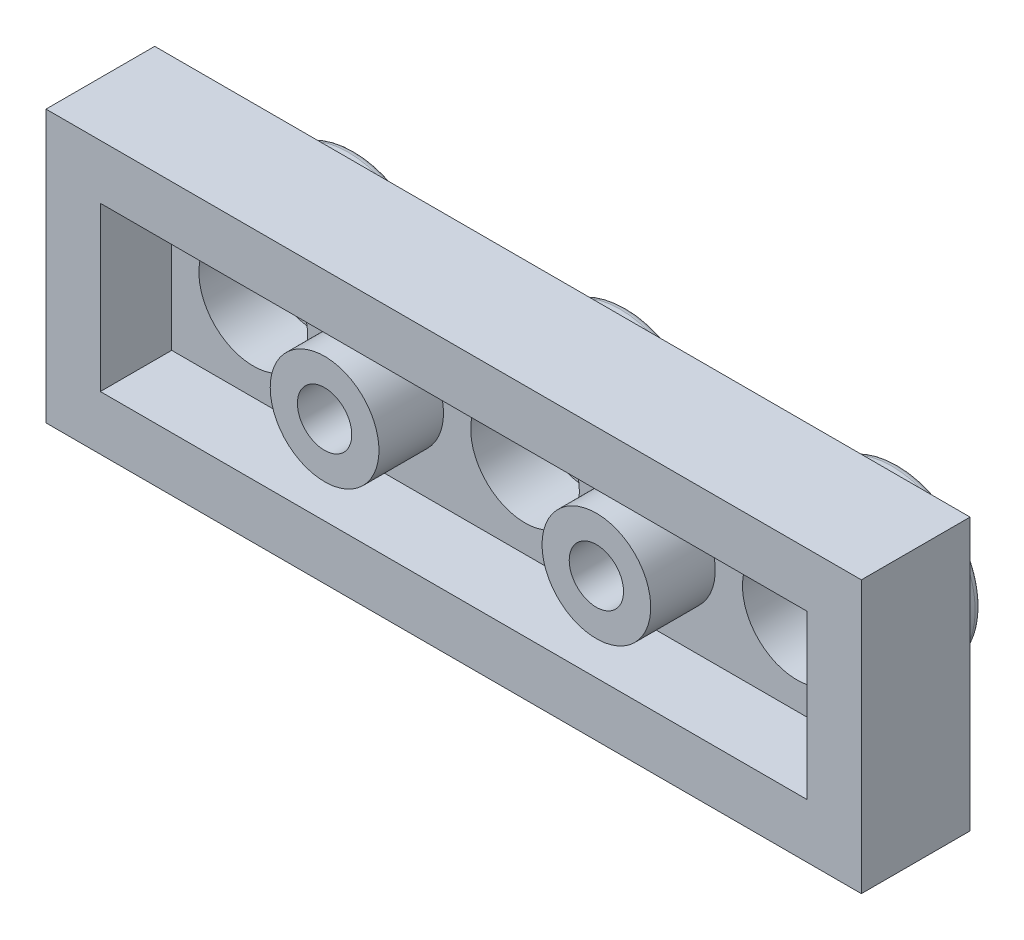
ISO-10303-21;
HEADER;
FILE_DESCRIPTION(('STEP AP214'),'2;1');
FILE_NAME('part.step','',(''),(''),'','','');
FILE_SCHEMA(('AUTOMOTIVE_DESIGN { 1 0 10303 214 1 1 1 1 }'));
ENDSEC;
DATA;
#1=APPLICATION_CONTEXT('core data for automotive mechanical design processes');
#2=APPLICATION_PROTOCOL_DEFINITION('international standard','automotive_design',2000,#1);
#3=PRODUCT_CONTEXT('',#1,'mechanical');
#4=PRODUCT('Part','Part','',(#3));
#5=PRODUCT_RELATED_PRODUCT_CATEGORY('part','',(#4));
#6=PRODUCT_DEFINITION_FORMATION('','',#4);
#7=PRODUCT_DEFINITION_CONTEXT('part definition',#1,'design');
#8=PRODUCT_DEFINITION('design','',#6,#7);
#9=PRODUCT_DEFINITION_SHAPE('','',#8);
#10=(LENGTH_UNIT() NAMED_UNIT(*) SI_UNIT(.MILLI.,.METRE.));
#11=(NAMED_UNIT(*) PLANE_ANGLE_UNIT() SI_UNIT($,.RADIAN.));
#12=(NAMED_UNIT(*) SI_UNIT($,.STERADIAN.) SOLID_ANGLE_UNIT());
#13=UNCERTAINTY_MEASURE_WITH_UNIT(LENGTH_MEASURE(1.E-05),#10,'distance_accuracy_value','');
#14=(GEOMETRIC_REPRESENTATION_CONTEXT(3) GLOBAL_UNCERTAINTY_ASSIGNED_CONTEXT((#13)) GLOBAL_UNIT_ASSIGNED_CONTEXT((#10,
#11,#12)) REPRESENTATION_CONTEXT('',''));
#15=CARTESIAN_POINT('',(0.,0.,0.));
#16=DIRECTION('',(0.,0.,1.));
#17=DIRECTION('',(1.,0.,0.));
#18=AXIS2_PLACEMENT_3D('',#15,#16,#17);
#19=CARTESIAN_POINT('',(-1.6,-1.6,1.1));
#20=DIRECTION('',(0.,0.,1.));
#21=DIRECTION('',(1.,0.,0.));
#22=AXIS2_PLACEMENT_3D('',#19,#20,#21);
#23=PLANE('',#22);
#24=CARTESIAN_POINT('',(-20.,-4.,1.1));
#25=DIRECTION('',(0.,0.,1.));
#26=DIRECTION('',(1.,0.,0.));
#27=AXIS2_PLACEMENT_3D('',#24,#25,#26);
#28=CIRCLE('',#27,1.6);
#29=CARTESIAN_POINT('',(-18.4,-4.,1.1));
#30=VERTEX_POINT('',#29);
#31=EDGE_CURVE('E285',#30,#30,#28,.T.);
#32=ORIENTED_EDGE('',*,*,#31,.F.);
#33=EDGE_LOOP('',(#32));
#34=FACE_BOUND('',#33,.T.);
#35=CARTESIAN_POINT('',(-12.,-4.,1.1));
#36=DIRECTION('',(0.,0.,1.));
#37=DIRECTION('',(1.,0.,0.));
#38=AXIS2_PLACEMENT_3D('',#35,#36,#37);
#39=CIRCLE('',#38,1.6);
#40=CARTESIAN_POINT('',(-10.4,-4.,1.1));
#41=VERTEX_POINT('',#40);
#42=EDGE_CURVE('E279',#41,#41,#39,.T.);
#43=ORIENTED_EDGE('',*,*,#42,.F.);
#44=EDGE_LOOP('',(#43));
#45=FACE_BOUND('',#44,.T.);
#46=CARTESIAN_POINT('',(-4.,-4.,1.1));
#47=DIRECTION('',(0.,0.,1.));
#48=DIRECTION('',(1.,0.,0.));
#49=AXIS2_PLACEMENT_3D('',#46,#47,#48);
#50=CIRCLE('',#49,1.6);
#51=CARTESIAN_POINT('',(-2.4,-4.,1.1));
#52=VERTEX_POINT('',#51);
#53=EDGE_CURVE('E264',#52,#52,#50,.T.);
#54=ORIENTED_EDGE('',*,*,#53,.F.);
#55=EDGE_LOOP('',(#54));
#56=FACE_BOUND('',#55,.T.);
#57=DIRECTION('',(0.,1.,0.));
#58=VECTOR('',#57,1.);
#59=CARTESIAN_POINT('',(-1.6,-6.4,1.1));
#60=LINE('',#59,#58);
#61=CARTESIAN_POINT('',(-1.6,-6.4,1.1));
#62=VERTEX_POINT('',#61);
#63=CARTESIAN_POINT('',(-1.6,-1.6,1.1));
#64=VERTEX_POINT('',#63);
#65=EDGE_CURVE('E115',#62,#64,#60,.T.);
#66=ORIENTED_EDGE('',*,*,#65,.T.);
#67=DIRECTION('',(-1.,0.,0.));
#68=VECTOR('',#67,1.);
#69=CARTESIAN_POINT('',(-1.6,-1.6,1.1));
#70=LINE('',#69,#68);
#71=CARTESIAN_POINT('',(-22.4,-1.6,1.1));
#72=VERTEX_POINT('',#71);
#73=EDGE_CURVE('E121',#64,#72,#70,.T.);
#74=ORIENTED_EDGE('',*,*,#73,.T.);
#75=DIRECTION('',(0.,-1.,0.));
#76=VECTOR('',#75,1.);
#77=CARTESIAN_POINT('',(-22.4,-6.40000000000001,1.1));
#78=LINE('',#77,#76);
#79=CARTESIAN_POINT('',(-22.4,-6.40000000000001,1.1));
#80=VERTEX_POINT('',#79);
#81=EDGE_CURVE('E99',#72,#80,#78,.T.);
#82=ORIENTED_EDGE('',*,*,#81,.T.);
#83=DIRECTION('',(1.,0.,0.));
#84=VECTOR('',#83,1.);
#85=CARTESIAN_POINT('',(-1.6,-6.4,1.1));
#86=LINE('',#85,#84);
#87=EDGE_CURVE('E124',#80,#62,#86,.T.);
#88=ORIENTED_EDGE('',*,*,#87,.T.);
#89=EDGE_LOOP('',(#66,#74,#82,#88));
#90=FACE_BOUND('',#89,.T.);
#91=CARTESIAN_POINT('',(-8.,-4.00000000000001,1.1));
#92=DIRECTION('',(0.,0.,1.));
#93=DIRECTION('',(1.,0.,0.));
#94=AXIS2_PLACEMENT_3D('',#91,#92,#93);
#95=CIRCLE('',#94,1.6);
#96=CARTESIAN_POINT('',(-9.6,-4.00000000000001,1.1));
#97=VERTEX_POINT('',#96);
#98=EDGE_CURVE('E252',#97,#97,#95,.T.);
#99=ORIENTED_EDGE('',*,*,#98,.F.);
#100=EDGE_LOOP('',(#99));
#101=FACE_BOUND('',#100,.T.);
#102=CARTESIAN_POINT('',(-16.,-4.00000000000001,1.1));
#103=DIRECTION('',(0.,0.,1.));
#104=DIRECTION('',(1.,0.,0.));
#105=AXIS2_PLACEMENT_3D('',#102,#103,#104);
#106=CIRCLE('',#105,1.6);
#107=CARTESIAN_POINT('',(-17.6,-4.00000000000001,1.1));
#108=VERTEX_POINT('',#107);
#109=EDGE_CURVE('E291',#108,#108,#106,.T.);
#110=ORIENTED_EDGE('',*,*,#109,.F.);
#111=EDGE_LOOP('',(#110));
#112=FACE_BOUND('',#111,.T.);
#113=ADVANCED_FACE('F26',(#34,#45,#56,#90,#101,#112),#23,.T.);
#114=CARTESIAN_POINT('',(0.,0.,0.));
#115=DIRECTION('',(0.,0.,-1.));
#116=DIRECTION('',(-1.,0.,0.));
#117=AXIS2_PLACEMENT_3D('',#114,#115,#116);
#118=PLANE('',#117);
#119=CARTESIAN_POINT('',(-4.,-4.,0.));
#120=DIRECTION('',(0.,0.,-1.));
#121=DIRECTION('',(-1.,0.,0.));
#122=AXIS2_PLACEMENT_3D('',#119,#120,#121);
#123=CIRCLE('',#122,2.45);
#124=CARTESIAN_POINT('',(-1.55,-4.,0.));
#125=VERTEX_POINT('',#124);
#126=EDGE_CURVE('E253',#125,#125,#123,.T.);
#127=ORIENTED_EDGE('',*,*,#126,.F.);
#128=EDGE_LOOP('',(#127));
#129=FACE_BOUND('',#128,.T.);
#130=DIRECTION('',(0.,1.,0.));
#131=VECTOR('',#130,1.);
#132=CARTESIAN_POINT('',(0.,0.,0.));
#133=LINE('',#132,#131);
#134=CARTESIAN_POINT('',(0.,-8.,0.));
#135=VERTEX_POINT('',#134);
#136=CARTESIAN_POINT('',(0.,0.,0.));
#137=VERTEX_POINT('',#136);
#138=EDGE_CURVE('E129',#135,#137,#133,.T.);
#139=ORIENTED_EDGE('',*,*,#138,.F.);
#140=DIRECTION('',(1.,0.,0.));
#141=VECTOR('',#140,1.);
#142=CARTESIAN_POINT('',(0.,-8.,0.));
#143=LINE('',#142,#141);
#144=CARTESIAN_POINT('',(-24.,-8.,0.));
#145=VERTEX_POINT('',#144);
#146=EDGE_CURVE('E138',#145,#135,#143,.T.);
#147=ORIENTED_EDGE('',*,*,#146,.F.);
#148=DIRECTION('',(0.,-1.,0.));
#149=VECTOR('',#148,1.);
#150=CARTESIAN_POINT('',(-24.,0.,0.));
#151=LINE('',#150,#149);
#152=CARTESIAN_POINT('',(-24.,0.,0.));
#153=VERTEX_POINT('',#152);
#154=EDGE_CURVE('E136',#153,#145,#151,.T.);
#155=ORIENTED_EDGE('',*,*,#154,.F.);
#156=DIRECTION('',(-1.,0.,0.));
#157=VECTOR('',#156,1.);
#158=CARTESIAN_POINT('',(0.,0.,0.));
#159=LINE('',#158,#157);
#160=EDGE_CURVE('E134',#137,#153,#159,.T.);
#161=ORIENTED_EDGE('',*,*,#160,.F.);
#162=EDGE_LOOP('',(#139,#147,#155,#161));
#163=FACE_BOUND('',#162,.T.);
#164=CARTESIAN_POINT('',(-12.,-4.,0.));
#165=DIRECTION('',(0.,0.,-1.));
#166=DIRECTION('',(-1.,0.,0.));
#167=AXIS2_PLACEMENT_3D('',#164,#165,#166);
#168=CIRCLE('',#167,2.45);
#169=CARTESIAN_POINT('',(-9.55,-4.,0.));
#170=VERTEX_POINT('',#169);
#171=EDGE_CURVE('E273',#170,#170,#168,.T.);
#172=ORIENTED_EDGE('',*,*,#171,.F.);
#173=EDGE_LOOP('',(#172));
#174=FACE_BOUND('',#173,.T.);
#175=CARTESIAN_POINT('',(-20.,-4.,0.));
#176=DIRECTION('',(0.,0.,-1.));
#177=DIRECTION('',(-1.,0.,0.));
#178=AXIS2_PLACEMENT_3D('',#175,#176,#177);
#179=CIRCLE('',#178,2.45);
#180=CARTESIAN_POINT('',(-17.55,-4.,0.));
#181=VERTEX_POINT('',#180);
#182=EDGE_CURVE('E168',#181,#181,#179,.T.);
#183=ORIENTED_EDGE('',*,*,#182,.F.);
#184=EDGE_LOOP('',(#183));
#185=FACE_BOUND('',#184,.T.);
#186=ADVANCED_FACE('F196',(#129,#163,#174,#185),#118,.T.);
#187=CARTESIAN_POINT('',(0.,0.,3.2));
#188=DIRECTION('',(-1.,0.,0.));
#189=DIRECTION('',(0.,-1.,0.));
#190=AXIS2_PLACEMENT_3D('',#187,#188,#189);
#191=PLANE('',#190);
#192=ORIENTED_EDGE('',*,*,#138,.T.);
#193=DIRECTION('',(0.,0.,-1.));
#194=VECTOR('',#193,1.);
#195=CARTESIAN_POINT('',(0.,0.,3.2));
#196=LINE('',#195,#194);
#197=CARTESIAN_POINT('',(0.,0.,3.2));
#198=VERTEX_POINT('',#197);
#199=EDGE_CURVE('E156',#198,#137,#196,.T.);
#200=ORIENTED_EDGE('',*,*,#199,.F.);
#201=DIRECTION('',(0.,1.,0.));
#202=VECTOR('',#201,1.);
#203=CARTESIAN_POINT('',(0.,0.,3.2));
#204=LINE('',#203,#202);
#205=CARTESIAN_POINT('',(0.,-8.,3.2));
#206=VERTEX_POINT('',#205);
#207=EDGE_CURVE('E140',#206,#198,#204,.T.);
#208=ORIENTED_EDGE('',*,*,#207,.F.);
#209=DIRECTION('',(0.,0.,-1.));
#210=VECTOR('',#209,1.);
#211=CARTESIAN_POINT('',(0.,-8.,3.2));
#212=LINE('',#211,#210);
#213=EDGE_CURVE('E147',#206,#135,#212,.T.);
#214=ORIENTED_EDGE('',*,*,#213,.T.);
#215=EDGE_LOOP('',(#192,#200,#208,#214));
#216=FACE_BOUND('',#215,.T.);
#217=ADVANCED_FACE('F206',(#216),#191,.F.);
#218=CARTESIAN_POINT('',(0.,0.,3.2));
#219=DIRECTION('',(0.,-1.,0.));
#220=DIRECTION('',(1.,0.,0.));
#221=AXIS2_PLACEMENT_3D('',#218,#219,#220);
#222=PLANE('',#221);
#223=ORIENTED_EDGE('',*,*,#160,.T.);
#224=DIRECTION('',(0.,0.,-1.));
#225=VECTOR('',#224,1.);
#226=CARTESIAN_POINT('',(-24.,0.,3.2));
#227=LINE('',#226,#225);
#228=CARTESIAN_POINT('',(-24.,0.,3.2));
#229=VERTEX_POINT('',#228);
#230=EDGE_CURVE('E153',#229,#153,#227,.T.);
#231=ORIENTED_EDGE('',*,*,#230,.F.);
#232=DIRECTION('',(-1.,0.,0.));
#233=VECTOR('',#232,1.);
#234=CARTESIAN_POINT('',(0.,0.,3.2));
#235=LINE('',#234,#233);
#236=EDGE_CURVE('E142',#198,#229,#235,.T.);
#237=ORIENTED_EDGE('',*,*,#236,.F.);
#238=ORIENTED_EDGE('',*,*,#199,.T.);
#239=EDGE_LOOP('',(#223,#231,#237,#238));
#240=FACE_BOUND('',#239,.T.);
#241=ADVANCED_FACE('F479',(#240),#222,.F.);
#242=CARTESIAN_POINT('',(-24.,0.,3.2));
#243=DIRECTION('',(1.,0.,0.));
#244=DIRECTION('',(0.,1.,0.));
#245=AXIS2_PLACEMENT_3D('',#242,#243,#244);
#246=PLANE('',#245);
#247=ORIENTED_EDGE('',*,*,#154,.T.);
#248=DIRECTION('',(0.,0.,-1.));
#249=VECTOR('',#248,1.);
#250=CARTESIAN_POINT('',(-24.,-8.,3.2));
#251=LINE('',#250,#249);
#252=CARTESIAN_POINT('',(-24.,-8.,3.2));
#253=VERTEX_POINT('',#252);
#254=EDGE_CURVE('E150',#253,#145,#251,.T.);
#255=ORIENTED_EDGE('',*,*,#254,.F.);
#256=DIRECTION('',(0.,-1.,0.));
#257=VECTOR('',#256,1.);
#258=CARTESIAN_POINT('',(-24.,0.,3.2));
#259=LINE('',#258,#257);
#260=EDGE_CURVE('E144',#229,#253,#259,.T.);
#261=ORIENTED_EDGE('',*,*,#260,.F.);
#262=ORIENTED_EDGE('',*,*,#230,.T.);
#263=EDGE_LOOP('',(#247,#255,#261,#262));
#264=FACE_BOUND('',#263,.T.);
#265=ADVANCED_FACE('F471',(#264),#246,.F.);
#266=CARTESIAN_POINT('',(0.,-8.,3.2));
#267=DIRECTION('',(0.,1.,0.));
#268=DIRECTION('',(-1.,0.,0.));
#269=AXIS2_PLACEMENT_3D('',#266,#267,#268);
#270=PLANE('',#269);
#271=ORIENTED_EDGE('',*,*,#146,.T.);
#272=ORIENTED_EDGE('',*,*,#213,.F.);
#273=DIRECTION('',(1.,0.,0.));
#274=VECTOR('',#273,1.);
#275=CARTESIAN_POINT('',(0.,-8.,3.2));
#276=LINE('',#275,#274);
#277=EDGE_CURVE('E49',#253,#206,#276,.T.);
#278=ORIENTED_EDGE('',*,*,#277,.F.);
#279=ORIENTED_EDGE('',*,*,#254,.T.);
#280=EDGE_LOOP('',(#271,#272,#278,#279));
#281=FACE_BOUND('',#280,.T.);
#282=ADVANCED_FACE('F464',(#281),#270,.F.);
#283=CARTESIAN_POINT('',(0.,0.,3.2));
#284=DIRECTION('',(0.,0.,-1.));
#285=DIRECTION('',(-1.,0.,0.));
#286=AXIS2_PLACEMENT_3D('',#283,#284,#285);
#287=PLANE('',#286);
#288=DIRECTION('',(-1.,0.,0.));
#289=VECTOR('',#288,1.);
#290=CARTESIAN_POINT('',(-1.6,-1.6,3.2));
#291=LINE('',#290,#289);
#292=CARTESIAN_POINT('',(-1.6,-1.6,3.2));
#293=VERTEX_POINT('',#292);
#294=CARTESIAN_POINT('',(-22.4,-1.6,3.2));
#295=VERTEX_POINT('',#294);
#296=EDGE_CURVE('E107',#293,#295,#291,.T.);
#297=ORIENTED_EDGE('',*,*,#296,.F.);
#298=DIRECTION('',(0.,1.,0.));
#299=VECTOR('',#298,1.);
#300=CARTESIAN_POINT('',(-1.6,-6.4,3.2));
#301=LINE('',#300,#299);
#302=CARTESIAN_POINT('',(-1.6,-6.4,3.2));
#303=VERTEX_POINT('',#302);
#304=EDGE_CURVE('E41',#303,#293,#301,.T.);
#305=ORIENTED_EDGE('',*,*,#304,.F.);
#306=DIRECTION('',(1.,0.,0.));
#307=VECTOR('',#306,1.);
#308=CARTESIAN_POINT('',(-1.6,-6.4,3.2));
#309=LINE('',#308,#307);
#310=CARTESIAN_POINT('',(-22.4,-6.40000000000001,3.2));
#311=VERTEX_POINT('',#310);
#312=EDGE_CURVE('E113',#311,#303,#309,.T.);
#313=ORIENTED_EDGE('',*,*,#312,.F.);
#314=DIRECTION('',(0.,-1.,0.));
#315=VECTOR('',#314,1.);
#316=CARTESIAN_POINT('',(-22.4,-6.40000000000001,3.2));
#317=LINE('',#316,#315);
#318=EDGE_CURVE('E96',#295,#311,#317,.T.);
#319=ORIENTED_EDGE('',*,*,#318,.F.);
#320=EDGE_LOOP('',(#297,#305,#313,#319));
#321=FACE_BOUND('',#320,.T.);
#322=ORIENTED_EDGE('',*,*,#207,.T.);
#323=ORIENTED_EDGE('',*,*,#236,.T.);
#324=ORIENTED_EDGE('',*,*,#260,.T.);
#325=ORIENTED_EDGE('',*,*,#277,.T.);
#326=EDGE_LOOP('',(#322,#323,#324,#325));
#327=FACE_BOUND('',#326,.T.);
#328=ADVANCED_FACE('F111',(#321,#327),#287,.F.);
#329=CARTESIAN_POINT('',(-1.6,-6.4,1.1));
#330=DIRECTION('',(1.,0.,0.));
#331=DIRECTION('',(0.,0.,-1.));
#332=AXIS2_PLACEMENT_3D('',#329,#330,#331);
#333=PLANE('',#332);
#334=ORIENTED_EDGE('',*,*,#304,.T.);
#335=DIRECTION('',(0.,0.,1.));
#336=VECTOR('',#335,1.);
#337=CARTESIAN_POINT('',(-1.6,-1.6,1.1));
#338=LINE('',#337,#336);
#339=EDGE_CURVE('E104',#64,#293,#338,.T.);
#340=ORIENTED_EDGE('',*,*,#339,.F.);
#341=ORIENTED_EDGE('',*,*,#65,.F.);
#342=DIRECTION('',(0.,0.,1.));
#343=VECTOR('',#342,1.);
#344=CARTESIAN_POINT('',(-1.6,-6.4,1.1));
#345=LINE('',#344,#343);
#346=EDGE_CURVE('E127',#62,#303,#345,.T.);
#347=ORIENTED_EDGE('',*,*,#346,.T.);
#348=EDGE_LOOP('',(#334,#340,#341,#347));
#349=FACE_BOUND('',#348,.T.);
#350=ADVANCED_FACE('F451',(#349),#333,.F.);
#351=CARTESIAN_POINT('',(-1.6,-6.4,1.1));
#352=DIRECTION('',(0.,-1.,0.));
#353=DIRECTION('',(1.,0.,0.));
#354=AXIS2_PLACEMENT_3D('',#351,#352,#353);
#355=PLANE('',#354);
#356=ORIENTED_EDGE('',*,*,#312,.T.);
#357=ORIENTED_EDGE('',*,*,#346,.F.);
#358=ORIENTED_EDGE('',*,*,#87,.F.);
#359=DIRECTION('',(0.,0.,1.));
#360=VECTOR('',#359,1.);
#361=CARTESIAN_POINT('',(-22.4,-6.40000000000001,1.1));
#362=LINE('',#361,#360);
#363=EDGE_CURVE('E103',#80,#311,#362,.T.);
#364=ORIENTED_EDGE('',*,*,#363,.T.);
#365=EDGE_LOOP('',(#356,#357,#358,#364));
#366=FACE_BOUND('',#365,.T.);
#367=ADVANCED_FACE('F444',(#366),#355,.F.);
#368=CARTESIAN_POINT('',(-22.4,-6.40000000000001,1.1));
#369=DIRECTION('',(-1.,0.,0.));
#370=DIRECTION('',(0.,0.,1.));
#371=AXIS2_PLACEMENT_3D('',#368,#369,#370);
#372=PLANE('',#371);
#373=ORIENTED_EDGE('',*,*,#318,.T.);
#374=ORIENTED_EDGE('',*,*,#363,.F.);
#375=ORIENTED_EDGE('',*,*,#81,.F.);
#376=DIRECTION('',(0.,0.,1.));
#377=VECTOR('',#376,1.);
#378=CARTESIAN_POINT('',(-22.4,-1.6,1.1));
#379=LINE('',#378,#377);
#380=EDGE_CURVE('E92',#72,#295,#379,.T.);
#381=ORIENTED_EDGE('',*,*,#380,.T.);
#382=EDGE_LOOP('',(#373,#374,#375,#381));
#383=FACE_BOUND('',#382,.T.);
#384=ADVANCED_FACE('F94',(#383),#372,.F.);
#385=CARTESIAN_POINT('',(-1.6,-1.6,1.1));
#386=DIRECTION('',(0.,1.,0.));
#387=DIRECTION('',(-1.,0.,0.));
#388=AXIS2_PLACEMENT_3D('',#385,#386,#387);
#389=PLANE('',#388);
#390=ORIENTED_EDGE('',*,*,#296,.T.);
#391=ORIENTED_EDGE('',*,*,#380,.F.);
#392=ORIENTED_EDGE('',*,*,#73,.F.);
#393=ORIENTED_EDGE('',*,*,#339,.T.);
#394=EDGE_LOOP('',(#390,#391,#392,#393));
#395=FACE_BOUND('',#394,.T.);
#396=ADVANCED_FACE('F108',(#395),#389,.F.);
#397=CARTESIAN_POINT('',(-8.,-4.00000000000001,3.));
#398=DIRECTION('',(0.,0.,1.));
#399=DIRECTION('',(1.,0.,0.));
#400=AXIS2_PLACEMENT_3D('',#397,#398,#399);
#401=PLANE('',#400);
#402=CARTESIAN_POINT('',(-8.,-4.00000000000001,3.));
#403=DIRECTION('',(0.,0.,1.));
#404=DIRECTION('',(1.,0.,0.));
#405=AXIS2_PLACEMENT_3D('',#402,#403,#404);
#406=CIRCLE('',#405,1.6);
#407=CARTESIAN_POINT('',(-9.6,-4.00000000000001,3.));
#408=VERTEX_POINT('',#407);
#409=EDGE_CURVE('E249',#408,#408,#406,.T.);
#410=ORIENTED_EDGE('',*,*,#409,.T.);
#411=EDGE_LOOP('',(#410));
#412=FACE_BOUND('',#411,.T.);
#413=CARTESIAN_POINT('',(-8.,-4.00000000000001,3.));
#414=DIRECTION('',(0.,0.,1.));
#415=DIRECTION('',(1.,0.,0.));
#416=AXIS2_PLACEMENT_3D('',#413,#414,#415);
#417=CIRCLE('',#416,0.799999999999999);
#418=CARTESIAN_POINT('',(-8.8,-4.00000000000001,3.));
#419=VERTEX_POINT('',#418);
#420=EDGE_CURVE('E251',#419,#419,#417,.T.);
#421=ORIENTED_EDGE('',*,*,#420,.F.);
#422=EDGE_LOOP('',(#421));
#423=FACE_BOUND('',#422,.T.);
#424=ADVANCED_FACE('F235',(#412,#423),#401,.T.);
#425=CARTESIAN_POINT('',(-8.,-4.00000000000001,3.));
#426=DIRECTION('',(0.,0.,-1.));
#427=DIRECTION('',(-1.,0.,0.));
#428=AXIS2_PLACEMENT_3D('',#425,#426,#427);
#429=CYLINDRICAL_SURFACE('',#428,1.6);
#430=CARTESIAN_POINT('',(-9.6,-4.00000000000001,3.));
#431=CARTESIAN_POINT('',(-9.6,-4.00000000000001,2.98020833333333));
#432=CARTESIAN_POINT('',(-9.6,-4.00000000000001,2.96041666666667));
#433=CARTESIAN_POINT('',(-9.6,-4.00000000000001,2.92083333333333));
#434=CARTESIAN_POINT('',(-9.6,-4.00000000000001,2.90104166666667));
#435=CARTESIAN_POINT('',(-9.6,-4.00000000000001,2.86145833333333));
#436=CARTESIAN_POINT('',(-9.6,-4.00000000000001,2.84166666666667));
#437=CARTESIAN_POINT('',(-9.6,-4.00000000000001,2.80208333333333));
#438=CARTESIAN_POINT('',(-9.6,-4.00000000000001,2.78229166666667));
#439=CARTESIAN_POINT('',(-9.6,-4.00000000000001,2.74270833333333));
#440=CARTESIAN_POINT('',(-9.6,-4.00000000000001,2.72291666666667));
#441=CARTESIAN_POINT('',(-9.6,-4.00000000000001,2.68333333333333));
#442=CARTESIAN_POINT('',(-9.6,-4.00000000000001,2.66354166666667));
#443=CARTESIAN_POINT('',(-9.6,-4.00000000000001,2.62395833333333));
#444=CARTESIAN_POINT('',(-9.6,-4.00000000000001,2.60416666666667));
#445=CARTESIAN_POINT('',(-9.6,-4.00000000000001,2.56458333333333));
#446=CARTESIAN_POINT('',(-9.6,-4.00000000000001,2.54479166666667));
#447=CARTESIAN_POINT('',(-9.6,-4.00000000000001,2.50520833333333));
#448=CARTESIAN_POINT('',(-9.6,-4.00000000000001,2.48541666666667));
#449=CARTESIAN_POINT('',(-9.6,-4.00000000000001,2.44583333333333));
#450=CARTESIAN_POINT('',(-9.6,-4.00000000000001,2.42604166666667));
#451=CARTESIAN_POINT('',(-9.6,-4.00000000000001,2.38645833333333));
#452=CARTESIAN_POINT('',(-9.6,-4.00000000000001,2.36666666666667));
#453=CARTESIAN_POINT('',(-9.6,-4.00000000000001,2.32708333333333));
#454=CARTESIAN_POINT('',(-9.6,-4.00000000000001,2.30729166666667));
#455=CARTESIAN_POINT('',(-9.6,-4.00000000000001,2.26770833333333));
#456=CARTESIAN_POINT('',(-9.6,-4.00000000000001,2.24791666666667));
#457=CARTESIAN_POINT('',(-9.6,-4.00000000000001,2.20833333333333));
#458=CARTESIAN_POINT('',(-9.6,-4.00000000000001,2.18854166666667));
#459=CARTESIAN_POINT('',(-9.6,-4.00000000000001,2.14895833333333));
#460=CARTESIAN_POINT('',(-9.6,-4.00000000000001,2.12916666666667));
#461=CARTESIAN_POINT('',(-9.6,-4.00000000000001,2.08958333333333));
#462=CARTESIAN_POINT('',(-9.6,-4.00000000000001,2.06979166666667));
#463=CARTESIAN_POINT('',(-9.6,-4.00000000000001,2.03020833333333));
#464=CARTESIAN_POINT('',(-9.6,-4.00000000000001,2.01041666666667));
#465=CARTESIAN_POINT('',(-9.6,-4.00000000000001,1.97083333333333));
#466=CARTESIAN_POINT('',(-9.6,-4.00000000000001,1.95104166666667));
#467=CARTESIAN_POINT('',(-9.6,-4.00000000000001,1.91145833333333));
#468=CARTESIAN_POINT('',(-9.6,-4.00000000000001,1.89166666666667));
#469=CARTESIAN_POINT('',(-9.6,-4.00000000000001,1.85208333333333));
#470=CARTESIAN_POINT('',(-9.6,-4.00000000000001,1.83229166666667));
#471=CARTESIAN_POINT('',(-9.6,-4.00000000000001,1.79270833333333));
#472=CARTESIAN_POINT('',(-9.6,-4.00000000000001,1.77291666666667));
#473=CARTESIAN_POINT('',(-9.6,-4.00000000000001,1.73333333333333));
#474=CARTESIAN_POINT('',(-9.6,-4.00000000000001,1.71354166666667));
#475=CARTESIAN_POINT('',(-9.6,-4.00000000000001,1.67395833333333));
#476=CARTESIAN_POINT('',(-9.6,-4.00000000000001,1.65416666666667));
#477=CARTESIAN_POINT('',(-9.6,-4.00000000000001,1.61458333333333));
#478=CARTESIAN_POINT('',(-9.6,-4.00000000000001,1.59479166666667));
#479=CARTESIAN_POINT('',(-9.6,-4.00000000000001,1.55520833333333));
#480=CARTESIAN_POINT('',(-9.6,-4.00000000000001,1.53541666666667));
#481=CARTESIAN_POINT('',(-9.6,-4.00000000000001,1.49583333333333));
#482=CARTESIAN_POINT('',(-9.6,-4.00000000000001,1.47604166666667));
#483=CARTESIAN_POINT('',(-9.6,-4.00000000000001,1.43645833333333));
#484=CARTESIAN_POINT('',(-9.6,-4.00000000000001,1.41666666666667));
#485=CARTESIAN_POINT('',(-9.6,-4.00000000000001,1.37708333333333));
#486=CARTESIAN_POINT('',(-9.6,-4.00000000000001,1.35729166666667));
#487=CARTESIAN_POINT('',(-9.6,-4.00000000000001,1.31770833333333));
#488=CARTESIAN_POINT('',(-9.6,-4.00000000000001,1.29791666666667));
#489=CARTESIAN_POINT('',(-9.6,-4.00000000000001,1.25833333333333));
#490=CARTESIAN_POINT('',(-9.6,-4.00000000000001,1.23854166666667));
#491=CARTESIAN_POINT('',(-9.6,-4.00000000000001,1.19895833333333));
#492=CARTESIAN_POINT('',(-9.6,-4.00000000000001,1.17916666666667));
#493=CARTESIAN_POINT('',(-9.6,-4.00000000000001,1.13958333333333));
#494=CARTESIAN_POINT('',(-9.6,-4.00000000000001,1.11979166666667));
#495=CARTESIAN_POINT('',(-9.6,-4.00000000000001,1.1));
#496=B_SPLINE_CURVE_WITH_KNOTS('',3,(#430,#431,#432,#433,#434,#435,#436,#437,#438,#439,#440,
#441,#442,#443,#444,#445,#446,#447,#448,#449,#450,#451,#452,#453,#454,#455,#456,#457,#458,#459,
#460,#461,#462,#463,#464,#465,#466,#467,#468,#469,#470,#471,#472,#473,#474,#475,#476,#477,#478,
#479,#480,#481,#482,#483,#484,#485,#486,#487,#488,#489,#490,#491,#492,#493,#494,#495),
.UNSPECIFIED.,.F.,.F.,(4,2,2,2,2,2,2,2,2,2,2,2,2,2,2,2,2,2,2,2,2,2,2,2,2,2,2,2,2,2,2,2,4),(0.,
0.0593750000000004,0.11875,0.178125,0.2375,0.296875,0.35625,0.415625,0.475,0.534375,0.59375,
0.653125,0.7125,0.771875,0.83125,0.890625,0.95,1.009375,1.06875,1.128125,1.1875,1.246875,
1.30625,1.365625,1.425,1.484375,1.54375,1.603125,1.6625,1.721875,1.78125,1.840625,1.9),.UNSPECIFIED.);
#497=EDGE_CURVE('BSEAM227',#408,#97,#496,.T.);
#498=ORIENTED_EDGE('',*,*,#409,.F.);
#499=ORIENTED_EDGE('',*,*,#98,.T.);
#500=ORIENTED_EDGE('',*,*,#497,.T.);
#501=ORIENTED_EDGE('',*,*,#497,.F.);
#502=EDGE_LOOP('',(#498,#500,#499,#501));
#503=FACE_BOUND('',#502,.T.);
#504=ADVANCED_FACE('F227',(#503),#429,.T.);
#505=CARTESIAN_POINT('',(-8.,-4.00000000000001,3.));
#506=DIRECTION('',(0.,0.,-1.));
#507=DIRECTION('',(-1.,0.,0.));
#508=AXIS2_PLACEMENT_3D('',#505,#506,#507);
#509=CYLINDRICAL_SURFACE('',#508,0.799999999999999);
#510=CARTESIAN_POINT('',(-8.,-4.00000000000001,1.1));
#511=DIRECTION('',(0.,0.,1.));
#512=DIRECTION('',(1.,0.,0.));
#513=AXIS2_PLACEMENT_3D('',#510,#511,#512);
#514=CIRCLE('',#513,0.799999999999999);
#515=CARTESIAN_POINT('',(-8.8,-4.00000000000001,1.1));
#516=VERTEX_POINT('',#515);
#517=EDGE_CURVE('E159',#516,#516,#514,.F.);
#518=CARTESIAN_POINT('',(-8.8,-4.00000000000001,3.));
#519=CARTESIAN_POINT('',(-8.8,-4.00000000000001,2.98020833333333));
#520=CARTESIAN_POINT('',(-8.8,-4.00000000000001,2.96041666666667));
#521=CARTESIAN_POINT('',(-8.8,-4.00000000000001,2.92083333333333));
#522=CARTESIAN_POINT('',(-8.8,-4.00000000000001,2.90104166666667));
#523=CARTESIAN_POINT('',(-8.8,-4.00000000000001,2.86145833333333));
#524=CARTESIAN_POINT('',(-8.8,-4.00000000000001,2.84166666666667));
#525=CARTESIAN_POINT('',(-8.8,-4.00000000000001,2.80208333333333));
#526=CARTESIAN_POINT('',(-8.8,-4.00000000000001,2.78229166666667));
#527=CARTESIAN_POINT('',(-8.8,-4.00000000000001,2.74270833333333));
#528=CARTESIAN_POINT('',(-8.8,-4.00000000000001,2.72291666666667));
#529=CARTESIAN_POINT('',(-8.8,-4.00000000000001,2.68333333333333));
#530=CARTESIAN_POINT('',(-8.8,-4.00000000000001,2.66354166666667));
#531=CARTESIAN_POINT('',(-8.8,-4.00000000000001,2.62395833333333));
#532=CARTESIAN_POINT('',(-8.8,-4.00000000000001,2.60416666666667));
#533=CARTESIAN_POINT('',(-8.8,-4.00000000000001,2.56458333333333));
#534=CARTESIAN_POINT('',(-8.8,-4.00000000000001,2.54479166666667));
#535=CARTESIAN_POINT('',(-8.8,-4.00000000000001,2.50520833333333));
#536=CARTESIAN_POINT('',(-8.8,-4.00000000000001,2.48541666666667));
#537=CARTESIAN_POINT('',(-8.8,-4.00000000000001,2.44583333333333));
#538=CARTESIAN_POINT('',(-8.8,-4.00000000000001,2.42604166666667));
#539=CARTESIAN_POINT('',(-8.8,-4.00000000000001,2.38645833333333));
#540=CARTESIAN_POINT('',(-8.8,-4.00000000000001,2.36666666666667));
#541=CARTESIAN_POINT('',(-8.8,-4.00000000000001,2.32708333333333));
#542=CARTESIAN_POINT('',(-8.8,-4.00000000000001,2.30729166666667));
#543=CARTESIAN_POINT('',(-8.8,-4.00000000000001,2.26770833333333));
#544=CARTESIAN_POINT('',(-8.8,-4.00000000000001,2.24791666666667));
#545=CARTESIAN_POINT('',(-8.8,-4.00000000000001,2.20833333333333));
#546=CARTESIAN_POINT('',(-8.8,-4.00000000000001,2.18854166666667));
#547=CARTESIAN_POINT('',(-8.8,-4.00000000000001,2.14895833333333));
#548=CARTESIAN_POINT('',(-8.8,-4.00000000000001,2.12916666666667));
#549=CARTESIAN_POINT('',(-8.8,-4.00000000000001,2.08958333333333));
#550=CARTESIAN_POINT('',(-8.8,-4.00000000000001,2.06979166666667));
#551=CARTESIAN_POINT('',(-8.8,-4.00000000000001,2.03020833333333));
#552=CARTESIAN_POINT('',(-8.8,-4.00000000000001,2.01041666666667));
#553=CARTESIAN_POINT('',(-8.8,-4.00000000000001,1.97083333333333));
#554=CARTESIAN_POINT('',(-8.8,-4.00000000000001,1.95104166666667));
#555=CARTESIAN_POINT('',(-8.8,-4.00000000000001,1.91145833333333));
#556=CARTESIAN_POINT('',(-8.8,-4.00000000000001,1.89166666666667));
#557=CARTESIAN_POINT('',(-8.8,-4.00000000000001,1.85208333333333));
#558=CARTESIAN_POINT('',(-8.8,-4.00000000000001,1.83229166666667));
#559=CARTESIAN_POINT('',(-8.8,-4.00000000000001,1.79270833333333));
#560=CARTESIAN_POINT('',(-8.8,-4.00000000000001,1.77291666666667));
#561=CARTESIAN_POINT('',(-8.8,-4.00000000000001,1.73333333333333));
#562=CARTESIAN_POINT('',(-8.8,-4.00000000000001,1.71354166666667));
#563=CARTESIAN_POINT('',(-8.8,-4.00000000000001,1.67395833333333));
#564=CARTESIAN_POINT('',(-8.8,-4.00000000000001,1.65416666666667));
#565=CARTESIAN_POINT('',(-8.8,-4.00000000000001,1.61458333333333));
#566=CARTESIAN_POINT('',(-8.8,-4.00000000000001,1.59479166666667));
#567=CARTESIAN_POINT('',(-8.8,-4.00000000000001,1.55520833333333));
#568=CARTESIAN_POINT('',(-8.8,-4.00000000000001,1.53541666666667));
#569=CARTESIAN_POINT('',(-8.8,-4.00000000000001,1.49583333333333));
#570=CARTESIAN_POINT('',(-8.8,-4.00000000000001,1.47604166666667));
#571=CARTESIAN_POINT('',(-8.8,-4.00000000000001,1.43645833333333));
#572=CARTESIAN_POINT('',(-8.8,-4.00000000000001,1.41666666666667));
#573=CARTESIAN_POINT('',(-8.8,-4.00000000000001,1.37708333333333));
#574=CARTESIAN_POINT('',(-8.8,-4.00000000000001,1.35729166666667));
#575=CARTESIAN_POINT('',(-8.8,-4.00000000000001,1.31770833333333));
#576=CARTESIAN_POINT('',(-8.8,-4.00000000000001,1.29791666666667));
#577=CARTESIAN_POINT('',(-8.8,-4.00000000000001,1.25833333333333));
#578=CARTESIAN_POINT('',(-8.8,-4.00000000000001,1.23854166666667));
#579=CARTESIAN_POINT('',(-8.8,-4.00000000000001,1.19895833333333));
#580=CARTESIAN_POINT('',(-8.8,-4.00000000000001,1.17916666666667));
#581=CARTESIAN_POINT('',(-8.8,-4.00000000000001,1.13958333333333));
#582=CARTESIAN_POINT('',(-8.8,-4.00000000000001,1.11979166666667));
#583=CARTESIAN_POINT('',(-8.8,-4.00000000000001,1.1));
#584=B_SPLINE_CURVE_WITH_KNOTS('',3,(#518,#519,#520,#521,#522,#523,#524,#525,#526,#527,#528,
#529,#530,#531,#532,#533,#534,#535,#536,#537,#538,#539,#540,#541,#542,#543,#544,#545,#546,#547,
#548,#549,#550,#551,#552,#553,#554,#555,#556,#557,#558,#559,#560,#561,#562,#563,#564,#565,#566,
#567,#568,#569,#570,#571,#572,#573,#574,#575,#576,#577,#578,#579,#580,#581,#582,#583),
.UNSPECIFIED.,.F.,.F.,(4,2,2,2,2,2,2,2,2,2,2,2,2,2,2,2,2,2,2,2,2,2,2,2,2,2,2,2,2,2,2,2,4),(0.,
0.0593750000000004,0.11875,0.178125,0.2375,0.296875,0.35625,0.415625,0.475,0.534375,0.59375,
0.653125,0.7125,0.771875,0.83125,0.890625,0.95,1.009375,1.06875,1.128125,1.1875,1.246875,
1.30625,1.365625,1.425,1.484375,1.54375,1.603125,1.6625,1.721875,1.78125,1.840625,1.9),.UNSPECIFIED.);
#585=EDGE_CURVE('BSEAM218',#419,#516,#584,.T.);
#586=ORIENTED_EDGE('',*,*,#420,.T.);
#587=ORIENTED_EDGE('',*,*,#517,.T.);
#588=ORIENTED_EDGE('',*,*,#585,.T.);
#589=ORIENTED_EDGE('',*,*,#585,.F.);
#590=EDGE_LOOP('',(#586,#588,#587,#589));
#591=FACE_BOUND('',#590,.T.);
#592=ADVANCED_FACE('F218',(#591),#509,.F.);
#593=ORIENTED_EDGE('',*,*,#517,.F.);
#594=EDGE_LOOP('',(#593));
#595=FACE_BOUND('',#594,.T.);
#596=ADVANCED_FACE('F200',(#595),#23,.T.);
#597=CARTESIAN_POINT('',(-4.,-4.,-1.9));
#598=DIRECTION('',(0.,0.,1.));
#599=DIRECTION('',(1.,0.,0.));
#600=AXIS2_PLACEMENT_3D('',#597,#598,#599);
#601=CYLINDRICAL_SURFACE('',#600,2.45);
#602=CARTESIAN_POINT('',(-4.,-4.,-1.7));
#603=DIRECTION('',(0.,0.,-1.));
#604=DIRECTION('',(-1.,0.,0.));
#605=AXIS2_PLACEMENT_3D('',#602,#603,#604);
#606=CIRCLE('',#605,2.45);
#607=CARTESIAN_POINT('',(-1.55,-4.,-1.7));
#608=VERTEX_POINT('',#607);
#609=EDGE_CURVE('E165',#608,#608,#606,.F.);
#610=CARTESIAN_POINT('',(-1.55,-4.,-1.7));
#611=CARTESIAN_POINT('',(-1.55,-4.,-1.68229166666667));
#612=CARTESIAN_POINT('',(-1.55,-4.,-1.66458333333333));
#613=CARTESIAN_POINT('',(-1.55,-4.,-1.62916666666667));
#614=CARTESIAN_POINT('',(-1.55,-4.,-1.61145833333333));
#615=CARTESIAN_POINT('',(-1.55,-4.,-1.57604166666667));
#616=CARTESIAN_POINT('',(-1.55,-4.,-1.55833333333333));
#617=CARTESIAN_POINT('',(-1.55,-4.,-1.52291666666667));
#618=CARTESIAN_POINT('',(-1.55,-4.,-1.50520833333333));
#619=CARTESIAN_POINT('',(-1.55,-4.,-1.46979166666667));
#620=CARTESIAN_POINT('',(-1.55,-4.,-1.45208333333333));
#621=CARTESIAN_POINT('',(-1.55,-4.,-1.41666666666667));
#622=CARTESIAN_POINT('',(-1.55,-4.,-1.39895833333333));
#623=CARTESIAN_POINT('',(-1.55,-4.,-1.36354166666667));
#624=CARTESIAN_POINT('',(-1.55,-4.,-1.34583333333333));
#625=CARTESIAN_POINT('',(-1.55,-4.,-1.31041666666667));
#626=CARTESIAN_POINT('',(-1.55,-4.,-1.29270833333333));
#627=CARTESIAN_POINT('',(-1.55,-4.,-1.25729166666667));
#628=CARTESIAN_POINT('',(-1.55,-4.,-1.23958333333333));
#629=CARTESIAN_POINT('',(-1.55,-4.,-1.20416666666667));
#630=CARTESIAN_POINT('',(-1.55,-4.,-1.18645833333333));
#631=CARTESIAN_POINT('',(-1.55,-4.,-1.15104166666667));
#632=CARTESIAN_POINT('',(-1.55,-4.,-1.13333333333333));
#633=CARTESIAN_POINT('',(-1.55,-4.,-1.09791666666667));
#634=CARTESIAN_POINT('',(-1.55,-4.,-1.08020833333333));
#635=CARTESIAN_POINT('',(-1.55,-4.,-1.04479166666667));
#636=CARTESIAN_POINT('',(-1.55,-4.,-1.02708333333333));
#637=CARTESIAN_POINT('',(-1.55,-4.,-0.991666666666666));
#638=CARTESIAN_POINT('',(-1.55,-4.,-0.973958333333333));
#639=CARTESIAN_POINT('',(-1.55,-4.,-0.938541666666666));
#640=CARTESIAN_POINT('',(-1.55,-4.,-0.920833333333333));
#641=CARTESIAN_POINT('',(-1.55,-4.,-0.885416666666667));
#642=CARTESIAN_POINT('',(-1.55,-4.,-0.867708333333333));
#643=CARTESIAN_POINT('',(-1.55,-4.,-0.832291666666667));
#644=CARTESIAN_POINT('',(-1.55,-4.,-0.814583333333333));
#645=CARTESIAN_POINT('',(-1.55,-4.,-0.779166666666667));
#646=CARTESIAN_POINT('',(-1.55,-4.,-0.761458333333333));
#647=CARTESIAN_POINT('',(-1.55,-4.,-0.726041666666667));
#648=CARTESIAN_POINT('',(-1.55,-4.,-0.708333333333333));
#649=CARTESIAN_POINT('',(-1.55,-4.,-0.672916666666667));
#650=CARTESIAN_POINT('',(-1.55,-4.,-0.655208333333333));
#651=CARTESIAN_POINT('',(-1.55,-4.,-0.619791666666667));
#652=CARTESIAN_POINT('',(-1.55,-4.,-0.602083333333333));
#653=CARTESIAN_POINT('',(-1.55,-4.,-0.566666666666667));
#654=CARTESIAN_POINT('',(-1.55,-4.,-0.548958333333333));
#655=CARTESIAN_POINT('',(-1.55,-4.,-0.513541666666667));
#656=CARTESIAN_POINT('',(-1.55,-4.,-0.495833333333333));
#657=CARTESIAN_POINT('',(-1.55,-4.,-0.460416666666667));
#658=CARTESIAN_POINT('',(-1.55,-4.,-0.442708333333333));
#659=CARTESIAN_POINT('',(-1.55,-4.,-0.407291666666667));
#660=CARTESIAN_POINT('',(-1.55,-4.,-0.389583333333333));
#661=CARTESIAN_POINT('',(-1.55,-4.,-0.354166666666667));
#662=CARTESIAN_POINT('',(-1.55,-4.,-0.336458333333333));
#663=CARTESIAN_POINT('',(-1.55,-4.,-0.301041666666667));
#664=CARTESIAN_POINT('',(-1.55,-4.,-0.283333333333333));
#665=CARTESIAN_POINT('',(-1.55,-4.,-0.247916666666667));
#666=CARTESIAN_POINT('',(-1.55,-4.,-0.230208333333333));
#667=CARTESIAN_POINT('',(-1.55,-4.,-0.194791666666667));
#668=CARTESIAN_POINT('',(-1.55,-4.,-0.177083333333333));
#669=CARTESIAN_POINT('',(-1.55,-4.,-0.141666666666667));
#670=CARTESIAN_POINT('',(-1.55,-4.,-0.123958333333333));
#671=CARTESIAN_POINT('',(-1.55,-4.,-0.0885416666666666));
#672=CARTESIAN_POINT('',(-1.55,-4.,-0.0708333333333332));
#673=CARTESIAN_POINT('',(-1.55,-4.,-0.0354166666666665));
#674=CARTESIAN_POINT('',(-1.55,-4.,-0.0177083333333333));
#675=CARTESIAN_POINT('',(-1.55,-4.,0.));
#676=B_SPLINE_CURVE_WITH_KNOTS('',3,(#610,#611,#612,#613,#614,#615,#616,#617,#618,#619,#620,
#621,#622,#623,#624,#625,#626,#627,#628,#629,#630,#631,#632,#633,#634,#635,#636,#637,#638,#639,
#640,#641,#642,#643,#644,#645,#646,#647,#648,#649,#650,#651,#652,#653,#654,#655,#656,#657,#658,
#659,#660,#661,#662,#663,#664,#665,#666,#667,#668,#669,#670,#671,#672,#673,#674,#675),
.UNSPECIFIED.,.F.,.F.,(4,2,2,2,2,2,2,2,2,2,2,2,2,2,2,2,2,2,2,2,2,2,2,2,2,2,2,2,2,2,2,2,4),(0.,
0.053125,0.10625,0.159375,0.2125,0.265625,0.31875,0.371875,0.425,0.478125,0.53125,0.584375,
0.6375,0.690625,0.74375,0.796875,0.85,0.903125,0.95625,1.009375,1.0625,1.115625,1.16875,
1.221875,1.275,1.328125,1.38125,1.434375,1.4875,1.540625,1.59375,1.646875,1.7),.UNSPECIFIED.);
#677=EDGE_CURVE('BSEAM217',#608,#125,#676,.T.);
#678=ORIENTED_EDGE('',*,*,#609,.T.);
#679=ORIENTED_EDGE('',*,*,#126,.T.);
#680=ORIENTED_EDGE('',*,*,#677,.T.);
#681=ORIENTED_EDGE('',*,*,#677,.F.);
#682=EDGE_LOOP('',(#678,#680,#679,#681));
#683=FACE_BOUND('',#682,.T.);
#684=ADVANCED_FACE('F217',(#683),#601,.T.);
#685=CARTESIAN_POINT('',(-4.,-4.,-1.9));
#686=DIRECTION('',(0.,0.,-1.));
#687=DIRECTION('',(-1.,0.,0.));
#688=AXIS2_PLACEMENT_3D('',#685,#686,#687);
#689=PLANE('',#688);
#690=CARTESIAN_POINT('',(-4.,-4.,-1.9));
#691=DIRECTION('',(0.,0.,-1.));
#692=DIRECTION('',(-1.,0.,0.));
#693=AXIS2_PLACEMENT_3D('',#690,#691,#692);
#694=CIRCLE('',#693,2.25);
#695=CARTESIAN_POINT('',(-6.25,-4.,-1.9));
#696=VERTEX_POINT('',#695);
#697=EDGE_CURVE('E162',#696,#696,#694,.T.);
#698=ORIENTED_EDGE('',*,*,#697,.T.);
#699=EDGE_LOOP('',(#698));
#700=FACE_BOUND('',#699,.T.);
#701=ADVANCED_FACE('F224',(#700),#689,.T.);
#702=CARTESIAN_POINT('',(-4.,-4.,-1.7));
#703=DIRECTION('',(0.,0.,-1.));
#704=DIRECTION('',(-1.,0.,0.));
#705=AXIS2_PLACEMENT_3D('',#702,#703,#704);
#706=TOROIDAL_SURFACE('',#705,2.25,0.2);
#707=ORIENTED_EDGE('',*,*,#609,.F.);
#708=EDGE_LOOP('',(#707));
#709=FACE_BOUND('',#708,.T.);
#710=ORIENTED_EDGE('',*,*,#697,.F.);
#711=EDGE_LOOP('',(#710));
#712=FACE_BOUND('',#711,.T.);
#713=ADVANCED_FACE('F335',(#709,#712),#706,.T.);
#714=CARTESIAN_POINT('',(-4.,-4.,-0.7));
#715=DIRECTION('',(0.,0.,1.));
#716=DIRECTION('',(1.,0.,0.));
#717=AXIS2_PLACEMENT_3D('',#714,#715,#716);
#718=CYLINDRICAL_SURFACE('',#717,1.6);
#719=CARTESIAN_POINT('',(-4.,-4.,-0.7));
#720=DIRECTION('',(0.,0.,1.));
#721=DIRECTION('',(1.,0.,0.));
#722=AXIS2_PLACEMENT_3D('',#719,#720,#721);
#723=CIRCLE('',#722,1.6);
#724=CARTESIAN_POINT('',(-2.4,-4.,-0.7));
#725=VERTEX_POINT('',#724);
#726=EDGE_CURVE('E258',#725,#725,#723,.T.);
#727=ORIENTED_EDGE('',*,*,#726,.F.);
#728=EDGE_LOOP('',(#727));
#729=FACE_BOUND('',#728,.T.);
#730=ORIENTED_EDGE('',*,*,#53,.T.);
#731=EDGE_LOOP('',(#730));
#732=FACE_BOUND('',#731,.T.);
#733=ADVANCED_FACE('F331',(#729,#732),#718,.F.);
#734=CARTESIAN_POINT('',(-4.,-4.,-0.7));
#735=DIRECTION('',(0.,0.,1.));
#736=DIRECTION('',(1.,0.,0.));
#737=AXIS2_PLACEMENT_3D('',#734,#735,#736);
#738=PLANE('',#737);
#739=ORIENTED_EDGE('',*,*,#726,.T.);
#740=EDGE_LOOP('',(#739));
#741=FACE_BOUND('',#740,.T.);
#742=ADVANCED_FACE('F190',(#741),#738,.T.);
#743=CARTESIAN_POINT('',(-12.,-4.,-1.9));
#744=DIRECTION('',(0.,0.,1.));
#745=DIRECTION('',(1.,0.,0.));
#746=AXIS2_PLACEMENT_3D('',#743,#744,#745);
#747=CYLINDRICAL_SURFACE('',#746,2.45);
#748=CARTESIAN_POINT('',(-12.,-4.,-1.7));
#749=DIRECTION('',(0.,0.,-1.));
#750=DIRECTION('',(-1.,0.,0.));
#751=AXIS2_PLACEMENT_3D('',#748,#749,#750);
#752=CIRCLE('',#751,2.45);
#753=CARTESIAN_POINT('',(-9.55,-4.,-1.7));
#754=VERTEX_POINT('',#753);
#755=EDGE_CURVE('E270',#754,#754,#752,.F.);
#756=CARTESIAN_POINT('',(-9.55,-4.,-1.7));
#757=CARTESIAN_POINT('',(-9.55,-4.,-1.68229166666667));
#758=CARTESIAN_POINT('',(-9.55,-4.,-1.66458333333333));
#759=CARTESIAN_POINT('',(-9.55,-4.,-1.62916666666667));
#760=CARTESIAN_POINT('',(-9.55,-4.,-1.61145833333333));
#761=CARTESIAN_POINT('',(-9.55,-4.,-1.57604166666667));
#762=CARTESIAN_POINT('',(-9.55,-4.,-1.55833333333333));
#763=CARTESIAN_POINT('',(-9.55,-4.,-1.52291666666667));
#764=CARTESIAN_POINT('',(-9.55,-4.,-1.50520833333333));
#765=CARTESIAN_POINT('',(-9.55,-4.,-1.46979166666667));
#766=CARTESIAN_POINT('',(-9.55,-4.,-1.45208333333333));
#767=CARTESIAN_POINT('',(-9.55,-4.,-1.41666666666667));
#768=CARTESIAN_POINT('',(-9.55,-4.,-1.39895833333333));
#769=CARTESIAN_POINT('',(-9.55,-4.,-1.36354166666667));
#770=CARTESIAN_POINT('',(-9.55,-4.,-1.34583333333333));
#771=CARTESIAN_POINT('',(-9.55,-4.,-1.31041666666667));
#772=CARTESIAN_POINT('',(-9.55,-4.,-1.29270833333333));
#773=CARTESIAN_POINT('',(-9.55,-4.,-1.25729166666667));
#774=CARTESIAN_POINT('',(-9.55,-4.,-1.23958333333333));
#775=CARTESIAN_POINT('',(-9.55,-4.,-1.20416666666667));
#776=CARTESIAN_POINT('',(-9.55,-4.,-1.18645833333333));
#777=CARTESIAN_POINT('',(-9.55,-4.,-1.15104166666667));
#778=CARTESIAN_POINT('',(-9.55,-4.,-1.13333333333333));
#779=CARTESIAN_POINT('',(-9.55,-4.,-1.09791666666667));
#780=CARTESIAN_POINT('',(-9.55,-4.,-1.08020833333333));
#781=CARTESIAN_POINT('',(-9.55,-4.,-1.04479166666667));
#782=CARTESIAN_POINT('',(-9.55,-4.,-1.02708333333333));
#783=CARTESIAN_POINT('',(-9.55,-4.,-0.991666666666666));
#784=CARTESIAN_POINT('',(-9.55,-4.,-0.973958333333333));
#785=CARTESIAN_POINT('',(-9.55,-4.,-0.938541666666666));
#786=CARTESIAN_POINT('',(-9.55,-4.,-0.920833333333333));
#787=CARTESIAN_POINT('',(-9.55,-4.,-0.885416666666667));
#788=CARTESIAN_POINT('',(-9.55,-4.,-0.867708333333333));
#789=CARTESIAN_POINT('',(-9.55,-4.,-0.832291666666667));
#790=CARTESIAN_POINT('',(-9.55,-4.,-0.814583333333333));
#791=CARTESIAN_POINT('',(-9.55,-4.,-0.779166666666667));
#792=CARTESIAN_POINT('',(-9.55,-4.,-0.761458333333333));
#793=CARTESIAN_POINT('',(-9.55,-4.,-0.726041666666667));
#794=CARTESIAN_POINT('',(-9.55,-4.,-0.708333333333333));
#795=CARTESIAN_POINT('',(-9.55,-4.,-0.672916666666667));
#796=CARTESIAN_POINT('',(-9.55,-4.,-0.655208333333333));
#797=CARTESIAN_POINT('',(-9.55,-4.,-0.619791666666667));
#798=CARTESIAN_POINT('',(-9.55,-4.,-0.602083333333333));
#799=CARTESIAN_POINT('',(-9.55,-4.,-0.566666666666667));
#800=CARTESIAN_POINT('',(-9.55,-4.,-0.548958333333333));
#801=CARTESIAN_POINT('',(-9.55,-4.,-0.513541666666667));
#802=CARTESIAN_POINT('',(-9.55,-4.,-0.495833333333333));
#803=CARTESIAN_POINT('',(-9.55,-4.,-0.460416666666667));
#804=CARTESIAN_POINT('',(-9.55,-4.,-0.442708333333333));
#805=CARTESIAN_POINT('',(-9.55,-4.,-0.407291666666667));
#806=CARTESIAN_POINT('',(-9.55,-4.,-0.389583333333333));
#807=CARTESIAN_POINT('',(-9.55,-4.,-0.354166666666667));
#808=CARTESIAN_POINT('',(-9.55,-4.,-0.336458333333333));
#809=CARTESIAN_POINT('',(-9.55,-4.,-0.301041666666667));
#810=CARTESIAN_POINT('',(-9.55,-4.,-0.283333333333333));
#811=CARTESIAN_POINT('',(-9.55,-4.,-0.247916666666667));
#812=CARTESIAN_POINT('',(-9.55,-4.,-0.230208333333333));
#813=CARTESIAN_POINT('',(-9.55,-4.,-0.194791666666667));
#814=CARTESIAN_POINT('',(-9.55,-4.,-0.177083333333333));
#815=CARTESIAN_POINT('',(-9.55,-4.,-0.141666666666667));
#816=CARTESIAN_POINT('',(-9.55,-4.,-0.123958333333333));
#817=CARTESIAN_POINT('',(-9.55,-4.,-0.0885416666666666));
#818=CARTESIAN_POINT('',(-9.55,-4.,-0.0708333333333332));
#819=CARTESIAN_POINT('',(-9.55,-4.,-0.0354166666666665));
#820=CARTESIAN_POINT('',(-9.55,-4.,-0.0177083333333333));
#821=CARTESIAN_POINT('',(-9.55,-4.,0.));
#822=B_SPLINE_CURVE_WITH_KNOTS('',3,(#756,#757,#758,#759,#760,#761,#762,#763,#764,#765,#766,
#767,#768,#769,#770,#771,#772,#773,#774,#775,#776,#777,#778,#779,#780,#781,#782,#783,#784,#785,
#786,#787,#788,#789,#790,#791,#792,#793,#794,#795,#796,#797,#798,#799,#800,#801,#802,#803,#804,
#805,#806,#807,#808,#809,#810,#811,#812,#813,#814,#815,#816,#817,#818,#819,#820,#821),
.UNSPECIFIED.,.F.,.F.,(4,2,2,2,2,2,2,2,2,2,2,2,2,2,2,2,2,2,2,2,2,2,2,2,2,2,2,2,2,2,2,2,4),(0.,
0.053125,0.10625,0.159375,0.2125,0.265625,0.31875,0.371875,0.425,0.478125,0.53125,0.584375,
0.6375,0.690625,0.74375,0.796875,0.85,0.903125,0.95625,1.009375,1.0625,1.115625,1.16875,
1.221875,1.275,1.328125,1.38125,1.434375,1.4875,1.540625,1.59375,1.646875,1.7),.UNSPECIFIED.);
#823=EDGE_CURVE('BSEAM181',#754,#170,#822,.T.);
#824=ORIENTED_EDGE('',*,*,#755,.T.);
#825=ORIENTED_EDGE('',*,*,#171,.T.);
#826=ORIENTED_EDGE('',*,*,#823,.T.);
#827=ORIENTED_EDGE('',*,*,#823,.F.);
#828=EDGE_LOOP('',(#824,#826,#825,#827));
#829=FACE_BOUND('',#828,.T.);
#830=ADVANCED_FACE('F181',(#829),#747,.T.);
#831=CARTESIAN_POINT('',(-12.,-4.,-1.9));
#832=DIRECTION('',(0.,0.,-1.));
#833=DIRECTION('',(-1.,0.,0.));
#834=AXIS2_PLACEMENT_3D('',#831,#832,#833);
#835=PLANE('',#834);
#836=CARTESIAN_POINT('',(-12.,-4.,-1.9));
#837=DIRECTION('',(0.,0.,-1.));
#838=DIRECTION('',(-1.,0.,0.));
#839=AXIS2_PLACEMENT_3D('',#836,#837,#838);
#840=CIRCLE('',#839,2.25);
#841=CARTESIAN_POINT('',(-14.25,-4.,-1.9));
#842=VERTEX_POINT('',#841);
#843=EDGE_CURVE('E267',#842,#842,#840,.T.);
#844=ORIENTED_EDGE('',*,*,#843,.T.);
#845=EDGE_LOOP('',(#844));
#846=FACE_BOUND('',#845,.T.);
#847=ADVANCED_FACE('F187',(#846),#835,.T.);
#848=CARTESIAN_POINT('',(-12.,-4.,-1.7));
#849=DIRECTION('',(0.,0.,-1.));
#850=DIRECTION('',(-1.,0.,0.));
#851=AXIS2_PLACEMENT_3D('',#848,#849,#850);
#852=TOROIDAL_SURFACE('',#851,2.25,0.2);
#853=ORIENTED_EDGE('',*,*,#755,.F.);
#854=EDGE_LOOP('',(#853));
#855=FACE_BOUND('',#854,.T.);
#856=ORIENTED_EDGE('',*,*,#843,.F.);
#857=EDGE_LOOP('',(#856));
#858=FACE_BOUND('',#857,.T.);
#859=ADVANCED_FACE('F179',(#855,#858),#852,.T.);
#860=CARTESIAN_POINT('',(-20.,-4.,-1.7));
#861=DIRECTION('',(0.,0.,-1.));
#862=DIRECTION('',(-1.,0.,0.));
#863=AXIS2_PLACEMENT_3D('',#860,#861,#862);
#864=TOROIDAL_SURFACE('',#863,2.25,0.2);
#865=CARTESIAN_POINT('',(-20.,-4.,-1.7));
#866=DIRECTION('',(0.,0.,-1.));
#867=DIRECTION('',(-1.,0.,0.));
#868=AXIS2_PLACEMENT_3D('',#865,#866,#867);
#869=CIRCLE('',#868,2.45);
#870=CARTESIAN_POINT('',(-17.55,-4.,-1.7));
#871=VERTEX_POINT('',#870);
#872=EDGE_CURVE('E171',#871,#871,#869,.F.);
#873=ORIENTED_EDGE('',*,*,#872,.F.);
#874=EDGE_LOOP('',(#873));
#875=FACE_BOUND('',#874,.T.);
#876=CARTESIAN_POINT('',(-20.,-4.,-1.9));
#877=DIRECTION('',(0.,0.,-1.));
#878=DIRECTION('',(-1.,0.,0.));
#879=AXIS2_PLACEMENT_3D('',#876,#877,#878);
#880=CIRCLE('',#879,2.25);
#881=CARTESIAN_POINT('',(-22.25,-4.,-1.9));
#882=VERTEX_POINT('',#881);
#883=EDGE_CURVE('E34',#882,#882,#880,.T.);
#884=ORIENTED_EDGE('',*,*,#883,.F.);
#885=EDGE_LOOP('',(#884));
#886=FACE_BOUND('',#885,.T.);
#887=ADVANCED_FACE('F28',(#875,#886),#864,.T.);
#888=CARTESIAN_POINT('',(-20.,-4.,-1.9));
#889=DIRECTION('',(0.,0.,-1.));
#890=DIRECTION('',(-1.,0.,0.));
#891=AXIS2_PLACEMENT_3D('',#888,#889,#890);
#892=PLANE('',#891);
#893=ORIENTED_EDGE('',*,*,#883,.T.);
#894=EDGE_LOOP('',(#893));
#895=FACE_BOUND('',#894,.T.);
#896=ADVANCED_FACE('F176',(#895),#892,.T.);
#897=CARTESIAN_POINT('',(-20.,-4.,-1.9));
#898=DIRECTION('',(0.,0.,1.));
#899=DIRECTION('',(1.,0.,0.));
#900=AXIS2_PLACEMENT_3D('',#897,#898,#899);
#901=CYLINDRICAL_SURFACE('',#900,2.45);
#902=CARTESIAN_POINT('',(-17.55,-4.,-1.7));
#903=CARTESIAN_POINT('',(-17.55,-4.,-1.68229166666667));
#904=CARTESIAN_POINT('',(-17.55,-4.,-1.66458333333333));
#905=CARTESIAN_POINT('',(-17.55,-4.,-1.62916666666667));
#906=CARTESIAN_POINT('',(-17.55,-4.,-1.61145833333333));
#907=CARTESIAN_POINT('',(-17.55,-4.,-1.57604166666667));
#908=CARTESIAN_POINT('',(-17.55,-4.,-1.55833333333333));
#909=CARTESIAN_POINT('',(-17.55,-4.,-1.52291666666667));
#910=CARTESIAN_POINT('',(-17.55,-4.,-1.50520833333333));
#911=CARTESIAN_POINT('',(-17.55,-4.,-1.46979166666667));
#912=CARTESIAN_POINT('',(-17.55,-4.,-1.45208333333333));
#913=CARTESIAN_POINT('',(-17.55,-4.,-1.41666666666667));
#914=CARTESIAN_POINT('',(-17.55,-4.,-1.39895833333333));
#915=CARTESIAN_POINT('',(-17.55,-4.,-1.36354166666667));
#916=CARTESIAN_POINT('',(-17.55,-4.,-1.34583333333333));
#917=CARTESIAN_POINT('',(-17.55,-4.,-1.31041666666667));
#918=CARTESIAN_POINT('',(-17.55,-4.,-1.29270833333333));
#919=CARTESIAN_POINT('',(-17.55,-4.,-1.25729166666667));
#920=CARTESIAN_POINT('',(-17.55,-4.,-1.23958333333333));
#921=CARTESIAN_POINT('',(-17.55,-4.,-1.20416666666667));
#922=CARTESIAN_POINT('',(-17.55,-4.,-1.18645833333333));
#923=CARTESIAN_POINT('',(-17.55,-4.,-1.15104166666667));
#924=CARTESIAN_POINT('',(-17.55,-4.,-1.13333333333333));
#925=CARTESIAN_POINT('',(-17.55,-4.,-1.09791666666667));
#926=CARTESIAN_POINT('',(-17.55,-4.,-1.08020833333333));
#927=CARTESIAN_POINT('',(-17.55,-4.,-1.04479166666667));
#928=CARTESIAN_POINT('',(-17.55,-4.,-1.02708333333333));
#929=CARTESIAN_POINT('',(-17.55,-4.,-0.991666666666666));
#930=CARTESIAN_POINT('',(-17.55,-4.,-0.973958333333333));
#931=CARTESIAN_POINT('',(-17.55,-4.,-0.938541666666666));
#932=CARTESIAN_POINT('',(-17.55,-4.,-0.920833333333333));
#933=CARTESIAN_POINT('',(-17.55,-4.,-0.885416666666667));
#934=CARTESIAN_POINT('',(-17.55,-4.,-0.867708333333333));
#935=CARTESIAN_POINT('',(-17.55,-4.,-0.832291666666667));
#936=CARTESIAN_POINT('',(-17.55,-4.,-0.814583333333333));
#937=CARTESIAN_POINT('',(-17.55,-4.,-0.779166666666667));
#938=CARTESIAN_POINT('',(-17.55,-4.,-0.761458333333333));
#939=CARTESIAN_POINT('',(-17.55,-4.,-0.726041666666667));
#940=CARTESIAN_POINT('',(-17.55,-4.,-0.708333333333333));
#941=CARTESIAN_POINT('',(-17.55,-4.,-0.672916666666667));
#942=CARTESIAN_POINT('',(-17.55,-4.,-0.655208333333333));
#943=CARTESIAN_POINT('',(-17.55,-4.,-0.619791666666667));
#944=CARTESIAN_POINT('',(-17.55,-4.,-0.602083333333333));
#945=CARTESIAN_POINT('',(-17.55,-4.,-0.566666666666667));
#946=CARTESIAN_POINT('',(-17.55,-4.,-0.548958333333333));
#947=CARTESIAN_POINT('',(-17.55,-4.,-0.513541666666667));
#948=CARTESIAN_POINT('',(-17.55,-4.,-0.495833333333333));
#949=CARTESIAN_POINT('',(-17.55,-4.,-0.460416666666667));
#950=CARTESIAN_POINT('',(-17.55,-4.,-0.442708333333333));
#951=CARTESIAN_POINT('',(-17.55,-4.,-0.407291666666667));
#952=CARTESIAN_POINT('',(-17.55,-4.,-0.389583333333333));
#953=CARTESIAN_POINT('',(-17.55,-4.,-0.354166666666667));
#954=CARTESIAN_POINT('',(-17.55,-4.,-0.336458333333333));
#955=CARTESIAN_POINT('',(-17.55,-4.,-0.301041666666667));
#956=CARTESIAN_POINT('',(-17.55,-4.,-0.283333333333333));
#957=CARTESIAN_POINT('',(-17.55,-4.,-0.247916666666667));
#958=CARTESIAN_POINT('',(-17.55,-4.,-0.230208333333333));
#959=CARTESIAN_POINT('',(-17.55,-4.,-0.194791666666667));
#960=CARTESIAN_POINT('',(-17.55,-4.,-0.177083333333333));
#961=CARTESIAN_POINT('',(-17.55,-4.,-0.141666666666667));
#962=CARTESIAN_POINT('',(-17.55,-4.,-0.123958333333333));
#963=CARTESIAN_POINT('',(-17.55,-4.,-0.0885416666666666));
#964=CARTESIAN_POINT('',(-17.55,-4.,-0.0708333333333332));
#965=CARTESIAN_POINT('',(-17.55,-4.,-0.0354166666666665));
#966=CARTESIAN_POINT('',(-17.55,-4.,-0.0177083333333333));
#967=CARTESIAN_POINT('',(-17.55,-4.,0.));
#968=B_SPLINE_CURVE_WITH_KNOTS('',3,(#902,#903,#904,#905,#906,#907,#908,#909,#910,#911,#912,
#913,#914,#915,#916,#917,#918,#919,#920,#921,#922,#923,#924,#925,#926,#927,#928,#929,#930,#931,
#932,#933,#934,#935,#936,#937,#938,#939,#940,#941,#942,#943,#944,#945,#946,#947,#948,#949,#950,
#951,#952,#953,#954,#955,#956,#957,#958,#959,#960,#961,#962,#963,#964,#965,#966,#967),
.UNSPECIFIED.,.F.,.F.,(4,2,2,2,2,2,2,2,2,2,2,2,2,2,2,2,2,2,2,2,2,2,2,2,2,2,2,2,2,2,2,2,4),(0.,
0.053125,0.10625,0.159375,0.2125,0.265625,0.31875,0.371875,0.425,0.478125,0.53125,0.584375,
0.6375,0.690625,0.74375,0.796875,0.85,0.903125,0.95625,1.009375,1.0625,1.115625,1.16875,
1.221875,1.275,1.328125,1.38125,1.434375,1.4875,1.540625,1.59375,1.646875,1.7),.UNSPECIFIED.);
#969=EDGE_CURVE('BSEAM186',#871,#181,#968,.T.);
#970=ORIENTED_EDGE('',*,*,#872,.T.);
#971=ORIENTED_EDGE('',*,*,#182,.T.);
#972=ORIENTED_EDGE('',*,*,#969,.T.);
#973=ORIENTED_EDGE('',*,*,#969,.F.);
#974=EDGE_LOOP('',(#970,#972,#971,#973));
#975=FACE_BOUND('',#974,.T.);
#976=ADVANCED_FACE('F186',(#975),#901,.T.);
#977=CARTESIAN_POINT('',(-12.,-4.,-0.7));
#978=DIRECTION('',(0.,0.,1.));
#979=DIRECTION('',(1.,0.,0.));
#980=AXIS2_PLACEMENT_3D('',#977,#978,#979);
#981=CYLINDRICAL_SURFACE('',#980,1.6);
#982=CARTESIAN_POINT('',(-12.,-4.,-0.7));
#983=DIRECTION('',(0.,0.,1.));
#984=DIRECTION('',(1.,0.,0.));
#985=AXIS2_PLACEMENT_3D('',#982,#983,#984);
#986=CIRCLE('',#985,1.6);
#987=CARTESIAN_POINT('',(-10.4,-4.,-0.7));
#988=VERTEX_POINT('',#987);
#989=EDGE_CURVE('E276',#988,#988,#986,.T.);
#990=ORIENTED_EDGE('',*,*,#989,.F.);
#991=EDGE_LOOP('',(#990));
#992=FACE_BOUND('',#991,.T.);
#993=ORIENTED_EDGE('',*,*,#42,.T.);
#994=EDGE_LOOP('',(#993));
#995=FACE_BOUND('',#994,.T.);
#996=ADVANCED_FACE('F321',(#992,#995),#981,.F.);
#997=CARTESIAN_POINT('',(-12.,-4.,-0.7));
#998=DIRECTION('',(0.,0.,1.));
#999=DIRECTION('',(1.,0.,0.));
#1000=AXIS2_PLACEMENT_3D('',#997,#998,#999);
#1001=PLANE('',#1000);
#1002=ORIENTED_EDGE('',*,*,#989,.T.);
#1003=EDGE_LOOP('',(#1002));
#1004=FACE_BOUND('',#1003,.T.);
#1005=ADVANCED_FACE('F317',(#1004),#1001,.T.);
#1006=CARTESIAN_POINT('',(-20.,-4.,-0.7));
#1007=DIRECTION('',(0.,0.,1.));
#1008=DIRECTION('',(1.,0.,0.));
#1009=AXIS2_PLACEMENT_3D('',#1006,#1007,#1008);
#1010=CYLINDRICAL_SURFACE('',#1009,1.6);
#1011=CARTESIAN_POINT('',(-20.,-4.,-0.7));
#1012=DIRECTION('',(0.,0.,1.));
#1013=DIRECTION('',(1.,0.,0.));
#1014=AXIS2_PLACEMENT_3D('',#1011,#1012,#1013);
#1015=CIRCLE('',#1014,1.6);
#1016=CARTESIAN_POINT('',(-18.4,-4.,-0.7));
#1017=VERTEX_POINT('',#1016);
#1018=EDGE_CURVE('E282',#1017,#1017,#1015,.T.);
#1019=ORIENTED_EDGE('',*,*,#1018,.F.);
#1020=EDGE_LOOP('',(#1019));
#1021=FACE_BOUND('',#1020,.T.);
#1022=ORIENTED_EDGE('',*,*,#31,.T.);
#1023=EDGE_LOOP('',(#1022));
#1024=FACE_BOUND('',#1023,.T.);
#1025=ADVANCED_FACE('F310',(#1021,#1024),#1010,.F.);
#1026=CARTESIAN_POINT('',(-20.,-4.,-0.7));
#1027=DIRECTION('',(0.,0.,1.));
#1028=DIRECTION('',(1.,0.,0.));
#1029=AXIS2_PLACEMENT_3D('',#1026,#1027,#1028);
#1030=PLANE('',#1029);
#1031=ORIENTED_EDGE('',*,*,#1018,.T.);
#1032=EDGE_LOOP('',(#1031));
#1033=FACE_BOUND('',#1032,.T.);
#1034=ADVANCED_FACE('F302',(#1033),#1030,.T.);
#1035=CARTESIAN_POINT('',(-16.,-4.00000000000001,3.));
#1036=DIRECTION('',(0.,0.,1.));
#1037=DIRECTION('',(1.,0.,0.));
#1038=AXIS2_PLACEMENT_3D('',#1035,#1036,#1037);
#1039=PLANE('',#1038);
#1040=CARTESIAN_POINT('',(-16.,-4.00000000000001,3.));
#1041=DIRECTION('',(0.,0.,1.));
#1042=DIRECTION('',(1.,0.,0.));
#1043=AXIS2_PLACEMENT_3D('',#1040,#1041,#1042);
#1044=CIRCLE('',#1043,1.6);
#1045=CARTESIAN_POINT('',(-17.6,-4.00000000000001,3.));
#1046=VERTEX_POINT('',#1045);
#1047=EDGE_CURVE('E288',#1046,#1046,#1044,.T.);
#1048=ORIENTED_EDGE('',*,*,#1047,.T.);
#1049=EDGE_LOOP('',(#1048));
#1050=FACE_BOUND('',#1049,.T.);
#1051=CARTESIAN_POINT('',(-16.,-4.00000000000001,3.));
#1052=DIRECTION('',(0.,0.,1.));
#1053=DIRECTION('',(1.,0.,0.));
#1054=AXIS2_PLACEMENT_3D('',#1051,#1052,#1053);
#1055=CIRCLE('',#1054,0.799999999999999);
#1056=CARTESIAN_POINT('',(-16.8,-4.00000000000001,3.));
#1057=VERTEX_POINT('',#1056);
#1058=EDGE_CURVE('E294',#1057,#1057,#1055,.T.);
#1059=ORIENTED_EDGE('',*,*,#1058,.F.);
#1060=EDGE_LOOP('',(#1059));
#1061=FACE_BOUND('',#1060,.T.);
#1062=ADVANCED_FACE('F300',(#1050,#1061),#1039,.T.);
#1063=CARTESIAN_POINT('',(-16.,-4.00000000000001,3.));
#1064=DIRECTION('',(0.,0.,-1.));
#1065=DIRECTION('',(-1.,0.,0.));
#1066=AXIS2_PLACEMENT_3D('',#1063,#1064,#1065);
#1067=CYLINDRICAL_SURFACE('',#1066,1.6);
#1068=CARTESIAN_POINT('',(-17.6,-4.00000000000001,3.));
#1069=CARTESIAN_POINT('',(-17.6,-4.00000000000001,2.98020833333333));
#1070=CARTESIAN_POINT('',(-17.6,-4.00000000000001,2.96041666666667));
#1071=CARTESIAN_POINT('',(-17.6,-4.00000000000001,2.92083333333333));
#1072=CARTESIAN_POINT('',(-17.6,-4.00000000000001,2.90104166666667));
#1073=CARTESIAN_POINT('',(-17.6,-4.00000000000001,2.86145833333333));
#1074=CARTESIAN_POINT('',(-17.6,-4.00000000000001,2.84166666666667));
#1075=CARTESIAN_POINT('',(-17.6,-4.00000000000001,2.80208333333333));
#1076=CARTESIAN_POINT('',(-17.6,-4.00000000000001,2.78229166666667));
#1077=CARTESIAN_POINT('',(-17.6,-4.00000000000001,2.74270833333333));
#1078=CARTESIAN_POINT('',(-17.6,-4.00000000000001,2.72291666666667));
#1079=CARTESIAN_POINT('',(-17.6,-4.00000000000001,2.68333333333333));
#1080=CARTESIAN_POINT('',(-17.6,-4.00000000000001,2.66354166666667));
#1081=CARTESIAN_POINT('',(-17.6,-4.00000000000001,2.62395833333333));
#1082=CARTESIAN_POINT('',(-17.6,-4.00000000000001,2.60416666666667));
#1083=CARTESIAN_POINT('',(-17.6,-4.00000000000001,2.56458333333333));
#1084=CARTESIAN_POINT('',(-17.6,-4.00000000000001,2.54479166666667));
#1085=CARTESIAN_POINT('',(-17.6,-4.00000000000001,2.50520833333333));
#1086=CARTESIAN_POINT('',(-17.6,-4.00000000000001,2.48541666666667));
#1087=CARTESIAN_POINT('',(-17.6,-4.00000000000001,2.44583333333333));
#1088=CARTESIAN_POINT('',(-17.6,-4.00000000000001,2.42604166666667));
#1089=CARTESIAN_POINT('',(-17.6,-4.00000000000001,2.38645833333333));
#1090=CARTESIAN_POINT('',(-17.6,-4.00000000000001,2.36666666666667));
#1091=CARTESIAN_POINT('',(-17.6,-4.00000000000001,2.32708333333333));
#1092=CARTESIAN_POINT('',(-17.6,-4.00000000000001,2.30729166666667));
#1093=CARTESIAN_POINT('',(-17.6,-4.00000000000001,2.26770833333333));
#1094=CARTESIAN_POINT('',(-17.6,-4.00000000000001,2.24791666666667));
#1095=CARTESIAN_POINT('',(-17.6,-4.00000000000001,2.20833333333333));
#1096=CARTESIAN_POINT('',(-17.6,-4.00000000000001,2.18854166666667));
#1097=CARTESIAN_POINT('',(-17.6,-4.00000000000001,2.14895833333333));
#1098=CARTESIAN_POINT('',(-17.6,-4.00000000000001,2.12916666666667));
#1099=CARTESIAN_POINT('',(-17.6,-4.00000000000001,2.08958333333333));
#1100=CARTESIAN_POINT('',(-17.6,-4.00000000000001,2.06979166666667));
#1101=CARTESIAN_POINT('',(-17.6,-4.00000000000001,2.03020833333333));
#1102=CARTESIAN_POINT('',(-17.6,-4.00000000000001,2.01041666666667));
#1103=CARTESIAN_POINT('',(-17.6,-4.00000000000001,1.97083333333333));
#1104=CARTESIAN_POINT('',(-17.6,-4.00000000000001,1.95104166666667));
#1105=CARTESIAN_POINT('',(-17.6,-4.00000000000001,1.91145833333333));
#1106=CARTESIAN_POINT('',(-17.6,-4.00000000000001,1.89166666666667));
#1107=CARTESIAN_POINT('',(-17.6,-4.00000000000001,1.85208333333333));
#1108=CARTESIAN_POINT('',(-17.6,-4.00000000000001,1.83229166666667));
#1109=CARTESIAN_POINT('',(-17.6,-4.00000000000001,1.79270833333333));
#1110=CARTESIAN_POINT('',(-17.6,-4.00000000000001,1.77291666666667));
#1111=CARTESIAN_POINT('',(-17.6,-4.00000000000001,1.73333333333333));
#1112=CARTESIAN_POINT('',(-17.6,-4.00000000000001,1.71354166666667));
#1113=CARTESIAN_POINT('',(-17.6,-4.00000000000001,1.67395833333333));
#1114=CARTESIAN_POINT('',(-17.6,-4.00000000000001,1.65416666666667));
#1115=CARTESIAN_POINT('',(-17.6,-4.00000000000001,1.61458333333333));
#1116=CARTESIAN_POINT('',(-17.6,-4.00000000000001,1.59479166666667));
#1117=CARTESIAN_POINT('',(-17.6,-4.00000000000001,1.55520833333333));
#1118=CARTESIAN_POINT('',(-17.6,-4.00000000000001,1.53541666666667));
#1119=CARTESIAN_POINT('',(-17.6,-4.00000000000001,1.49583333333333));
#1120=CARTESIAN_POINT('',(-17.6,-4.00000000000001,1.47604166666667));
#1121=CARTESIAN_POINT('',(-17.6,-4.00000000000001,1.43645833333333));
#1122=CARTESIAN_POINT('',(-17.6,-4.00000000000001,1.41666666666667));
#1123=CARTESIAN_POINT('',(-17.6,-4.00000000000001,1.37708333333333));
#1124=CARTESIAN_POINT('',(-17.6,-4.00000000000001,1.35729166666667));
#1125=CARTESIAN_POINT('',(-17.6,-4.00000000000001,1.31770833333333));
#1126=CARTESIAN_POINT('',(-17.6,-4.00000000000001,1.29791666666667));
#1127=CARTESIAN_POINT('',(-17.6,-4.00000000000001,1.25833333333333));
#1128=CARTESIAN_POINT('',(-17.6,-4.00000000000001,1.23854166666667));
#1129=CARTESIAN_POINT('',(-17.6,-4.00000000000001,1.19895833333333));
#1130=CARTESIAN_POINT('',(-17.6,-4.00000000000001,1.17916666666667));
#1131=CARTESIAN_POINT('',(-17.6,-4.00000000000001,1.13958333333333));
#1132=CARTESIAN_POINT('',(-17.6,-4.00000000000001,1.11979166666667));
#1133=CARTESIAN_POINT('',(-17.6,-4.00000000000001,1.1));
#1134=B_SPLINE_CURVE_WITH_KNOTS('',3,(#1068,#1069,#1070,#1071,#1072,#1073,#1074,#1075,#1076,
#1077,#1078,#1079,#1080,#1081,#1082,#1083,#1084,#1085,#1086,#1087,#1088,#1089,#1090,#1091,#1092,
#1093,#1094,#1095,#1096,#1097,#1098,#1099,#1100,#1101,#1102,#1103,#1104,#1105,#1106,#1107,#1108,
#1109,#1110,#1111,#1112,#1113,#1114,#1115,#1116,#1117,#1118,#1119,#1120,#1121,#1122,#1123,#1124,
#1125,#1126,#1127,#1128,#1129,#1130,#1131,#1132,#1133),.UNSPECIFIED.,.F.,.F.,(4,2,2,2,2,2,2,2,2,
2,2,2,2,2,2,2,2,2,2,2,2,2,2,2,2,2,2,2,2,2,2,2,4),(0.,0.0593750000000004,0.11875,0.178125,0.2375,
0.296875,0.35625,0.415625,0.475,0.534375,0.59375,0.653125,0.7125,0.771875,0.83125,0.890625,0.95,
1.009375,1.06875,1.128125,1.1875,1.246875,1.30625,1.365625,1.425,1.484375,1.54375,1.603125,
1.6625,1.721875,1.78125,1.840625,1.9),.UNSPECIFIED.);
#1135=EDGE_CURVE('BSEAM301',#1046,#108,#1134,.T.);
#1136=ORIENTED_EDGE('',*,*,#1047,.F.);
#1137=ORIENTED_EDGE('',*,*,#109,.T.);
#1138=ORIENTED_EDGE('',*,*,#1135,.T.);
#1139=ORIENTED_EDGE('',*,*,#1135,.F.);
#1140=EDGE_LOOP('',(#1136,#1138,#1137,#1139));
#1141=FACE_BOUND('',#1140,.T.);
#1142=ADVANCED_FACE('F301',(#1141),#1067,.T.);
#1143=CARTESIAN_POINT('',(-16.,-4.00000000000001,3.));
#1144=DIRECTION('',(0.,0.,-1.));
#1145=DIRECTION('',(-1.,0.,0.));
#1146=AXIS2_PLACEMENT_3D('',#1143,#1144,#1145);
#1147=CYLINDRICAL_SURFACE('',#1146,0.799999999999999);
#1148=CARTESIAN_POINT('',(-16.,-4.00000000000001,1.1));
#1149=DIRECTION('',(0.,0.,1.));
#1150=DIRECTION('',(1.,0.,0.));
#1151=AXIS2_PLACEMENT_3D('',#1148,#1149,#1150);
#1152=CIRCLE('',#1151,0.799999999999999);
#1153=CARTESIAN_POINT('',(-16.8,-4.00000000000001,1.1));
#1154=VERTEX_POINT('',#1153);
#1155=EDGE_CURVE('E11',#1154,#1154,#1152,.F.);
#1156=CARTESIAN_POINT('',(-16.8,-4.00000000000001,3.));
#1157=CARTESIAN_POINT('',(-16.8,-4.00000000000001,2.98020833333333));
#1158=CARTESIAN_POINT('',(-16.8,-4.00000000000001,2.96041666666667));
#1159=CARTESIAN_POINT('',(-16.8,-4.00000000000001,2.92083333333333));
#1160=CARTESIAN_POINT('',(-16.8,-4.00000000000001,2.90104166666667));
#1161=CARTESIAN_POINT('',(-16.8,-4.00000000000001,2.86145833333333));
#1162=CARTESIAN_POINT('',(-16.8,-4.00000000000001,2.84166666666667));
#1163=CARTESIAN_POINT('',(-16.8,-4.00000000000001,2.80208333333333));
#1164=CARTESIAN_POINT('',(-16.8,-4.00000000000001,2.78229166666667));
#1165=CARTESIAN_POINT('',(-16.8,-4.00000000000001,2.74270833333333));
#1166=CARTESIAN_POINT('',(-16.8,-4.00000000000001,2.72291666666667));
#1167=CARTESIAN_POINT('',(-16.8,-4.00000000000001,2.68333333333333));
#1168=CARTESIAN_POINT('',(-16.8,-4.00000000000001,2.66354166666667));
#1169=CARTESIAN_POINT('',(-16.8,-4.00000000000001,2.62395833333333));
#1170=CARTESIAN_POINT('',(-16.8,-4.00000000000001,2.60416666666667));
#1171=CARTESIAN_POINT('',(-16.8,-4.00000000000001,2.56458333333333));
#1172=CARTESIAN_POINT('',(-16.8,-4.00000000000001,2.54479166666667));
#1173=CARTESIAN_POINT('',(-16.8,-4.00000000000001,2.50520833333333));
#1174=CARTESIAN_POINT('',(-16.8,-4.00000000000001,2.48541666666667));
#1175=CARTESIAN_POINT('',(-16.8,-4.00000000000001,2.44583333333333));
#1176=CARTESIAN_POINT('',(-16.8,-4.00000000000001,2.42604166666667));
#1177=CARTESIAN_POINT('',(-16.8,-4.00000000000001,2.38645833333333));
#1178=CARTESIAN_POINT('',(-16.8,-4.00000000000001,2.36666666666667));
#1179=CARTESIAN_POINT('',(-16.8,-4.00000000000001,2.32708333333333));
#1180=CARTESIAN_POINT('',(-16.8,-4.00000000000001,2.30729166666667));
#1181=CARTESIAN_POINT('',(-16.8,-4.00000000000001,2.26770833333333));
#1182=CARTESIAN_POINT('',(-16.8,-4.00000000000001,2.24791666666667));
#1183=CARTESIAN_POINT('',(-16.8,-4.00000000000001,2.20833333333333));
#1184=CARTESIAN_POINT('',(-16.8,-4.00000000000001,2.18854166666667));
#1185=CARTESIAN_POINT('',(-16.8,-4.00000000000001,2.14895833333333));
#1186=CARTESIAN_POINT('',(-16.8,-4.00000000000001,2.12916666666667));
#1187=CARTESIAN_POINT('',(-16.8,-4.00000000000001,2.08958333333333));
#1188=CARTESIAN_POINT('',(-16.8,-4.00000000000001,2.06979166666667));
#1189=CARTESIAN_POINT('',(-16.8,-4.00000000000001,2.03020833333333));
#1190=CARTESIAN_POINT('',(-16.8,-4.00000000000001,2.01041666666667));
#1191=CARTESIAN_POINT('',(-16.8,-4.00000000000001,1.97083333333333));
#1192=CARTESIAN_POINT('',(-16.8,-4.00000000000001,1.95104166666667));
#1193=CARTESIAN_POINT('',(-16.8,-4.00000000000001,1.91145833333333));
#1194=CARTESIAN_POINT('',(-16.8,-4.00000000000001,1.89166666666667));
#1195=CARTESIAN_POINT('',(-16.8,-4.00000000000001,1.85208333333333));
#1196=CARTESIAN_POINT('',(-16.8,-4.00000000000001,1.83229166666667));
#1197=CARTESIAN_POINT('',(-16.8,-4.00000000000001,1.79270833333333));
#1198=CARTESIAN_POINT('',(-16.8,-4.00000000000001,1.77291666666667));
#1199=CARTESIAN_POINT('',(-16.8,-4.00000000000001,1.73333333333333));
#1200=CARTESIAN_POINT('',(-16.8,-4.00000000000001,1.71354166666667));
#1201=CARTESIAN_POINT('',(-16.8,-4.00000000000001,1.67395833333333));
#1202=CARTESIAN_POINT('',(-16.8,-4.00000000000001,1.65416666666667));
#1203=CARTESIAN_POINT('',(-16.8,-4.00000000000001,1.61458333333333));
#1204=CARTESIAN_POINT('',(-16.8,-4.00000000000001,1.59479166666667));
#1205=CARTESIAN_POINT('',(-16.8,-4.00000000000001,1.55520833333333));
#1206=CARTESIAN_POINT('',(-16.8,-4.00000000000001,1.53541666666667));
#1207=CARTESIAN_POINT('',(-16.8,-4.00000000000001,1.49583333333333));
#1208=CARTESIAN_POINT('',(-16.8,-4.00000000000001,1.47604166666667));
#1209=CARTESIAN_POINT('',(-16.8,-4.00000000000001,1.43645833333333));
#1210=CARTESIAN_POINT('',(-16.8,-4.00000000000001,1.41666666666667));
#1211=CARTESIAN_POINT('',(-16.8,-4.00000000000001,1.37708333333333));
#1212=CARTESIAN_POINT('',(-16.8,-4.00000000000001,1.35729166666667));
#1213=CARTESIAN_POINT('',(-16.8,-4.00000000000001,1.31770833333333));
#1214=CARTESIAN_POINT('',(-16.8,-4.00000000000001,1.29791666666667));
#1215=CARTESIAN_POINT('',(-16.8,-4.00000000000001,1.25833333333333));
#1216=CARTESIAN_POINT('',(-16.8,-4.00000000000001,1.23854166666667));
#1217=CARTESIAN_POINT('',(-16.8,-4.00000000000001,1.19895833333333));
#1218=CARTESIAN_POINT('',(-16.8,-4.00000000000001,1.17916666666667));
#1219=CARTESIAN_POINT('',(-16.8,-4.00000000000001,1.13958333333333));
#1220=CARTESIAN_POINT('',(-16.8,-4.00000000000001,1.11979166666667));
#1221=CARTESIAN_POINT('',(-16.8,-4.00000000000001,1.1));
#1222=B_SPLINE_CURVE_WITH_KNOTS('',3,(#1156,#1157,#1158,#1159,#1160,#1161,#1162,#1163,#1164,
#1165,#1166,#1167,#1168,#1169,#1170,#1171,#1172,#1173,#1174,#1175,#1176,#1177,#1178,#1179,#1180,
#1181,#1182,#1183,#1184,#1185,#1186,#1187,#1188,#1189,#1190,#1191,#1192,#1193,#1194,#1195,#1196,
#1197,#1198,#1199,#1200,#1201,#1202,#1203,#1204,#1205,#1206,#1207,#1208,#1209,#1210,#1211,#1212,
#1213,#1214,#1215,#1216,#1217,#1218,#1219,#1220,#1221),.UNSPECIFIED.,.F.,.F.,(4,2,2,2,2,2,2,2,2,
2,2,2,2,2,2,2,2,2,2,2,2,2,2,2,2,2,2,2,2,2,2,2,4),(0.,0.0593750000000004,0.11875,0.178125,0.2375,
0.296875,0.35625,0.415625,0.475,0.534375,0.59375,0.653125,0.7125,0.771875,0.83125,0.890625,0.95,
1.009375,1.06875,1.128125,1.1875,1.246875,1.30625,1.365625,1.425,1.484375,1.54375,1.603125,
1.6625,1.721875,1.78125,1.840625,1.9),.UNSPECIFIED.);
#1223=EDGE_CURVE('BSEAM214',#1057,#1154,#1222,.T.);
#1224=ORIENTED_EDGE('',*,*,#1058,.T.);
#1225=ORIENTED_EDGE('',*,*,#1155,.T.);
#1226=ORIENTED_EDGE('',*,*,#1223,.T.);
#1227=ORIENTED_EDGE('',*,*,#1223,.F.);
#1228=EDGE_LOOP('',(#1224,#1226,#1225,#1227));
#1229=FACE_BOUND('',#1228,.T.);
#1230=ADVANCED_FACE('F214',(#1229),#1147,.F.);
#1231=ORIENTED_EDGE('',*,*,#1155,.F.);
#1232=EDGE_LOOP('',(#1231));
#1233=FACE_BOUND('',#1232,.T.);
#1234=ADVANCED_FACE('F199',(#1233),#23,.T.);
#1235=CLOSED_SHELL('',(#113,#186,#217,#241,#265,#282,#328,#350,#367,#384,#396,#424,#504,#592,
#596,#684,#701,#713,#733,#742,#830,#847,#859,#887,#896,#976,#996,#1005,#1025,#1034,#1062,#1142,
#1230,#1234));
#1236=MANIFOLD_SOLID_BREP('B2',#1235);
#1237=ADVANCED_BREP_SHAPE_REPRESENTATION('',(#18,#1236),#14);
#1238=SHAPE_DEFINITION_REPRESENTATION(#9,#1237);
ENDSEC;
END-ISO-10303-21;
